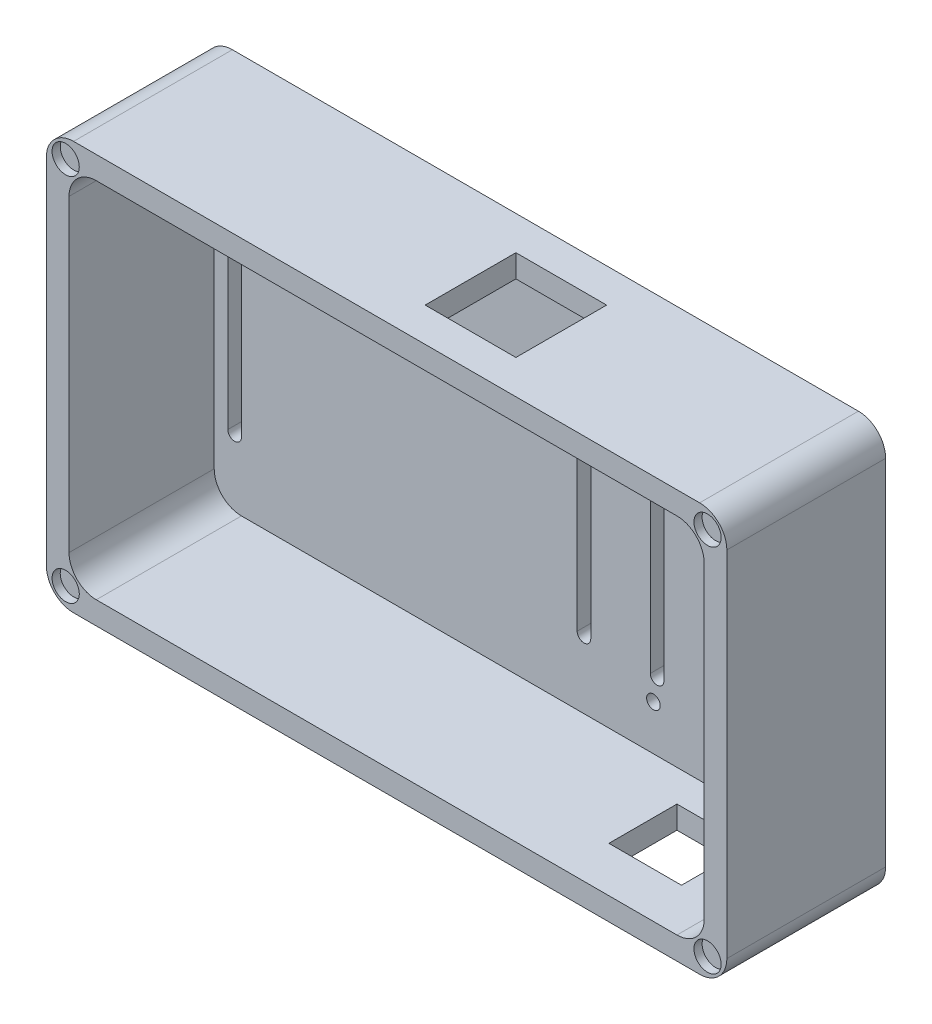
ISO-10303-21;
HEADER;
FILE_DESCRIPTION(('STEP AP214'),'2;1');
FILE_NAME('part.step','',(''),(''),'','','');
FILE_SCHEMA(('AUTOMOTIVE_DESIGN { 1 0 10303 214 1 1 1 1 }'));
ENDSEC;
DATA;
#1=APPLICATION_CONTEXT('core data for automotive mechanical design processes');
#2=APPLICATION_PROTOCOL_DEFINITION('international standard','automotive_design',2000,#1);
#3=PRODUCT_CONTEXT('',#1,'mechanical');
#4=PRODUCT('Part','Part','',(#3));
#5=PRODUCT_RELATED_PRODUCT_CATEGORY('part','',(#4));
#6=PRODUCT_DEFINITION_FORMATION('','',#4);
#7=PRODUCT_DEFINITION_CONTEXT('part definition',#1,'design');
#8=PRODUCT_DEFINITION('design','',#6,#7);
#9=PRODUCT_DEFINITION_SHAPE('','',#8);
#10=(LENGTH_UNIT() NAMED_UNIT(*) SI_UNIT(.MILLI.,.METRE.));
#11=(NAMED_UNIT(*) PLANE_ANGLE_UNIT() SI_UNIT($,.RADIAN.));
#12=(NAMED_UNIT(*) SI_UNIT($,.STERADIAN.) SOLID_ANGLE_UNIT());
#13=UNCERTAINTY_MEASURE_WITH_UNIT(LENGTH_MEASURE(1.E-05),#10,'distance_accuracy_value','');
#14=(GEOMETRIC_REPRESENTATION_CONTEXT(3) GLOBAL_UNCERTAINTY_ASSIGNED_CONTEXT((#13)) GLOBAL_UNIT_ASSIGNED_CONTEXT((#10,
#11,#12)) REPRESENTATION_CONTEXT('',''));
#15=CARTESIAN_POINT('',(0.,0.,0.));
#16=DIRECTION('',(0.,0.,1.));
#17=DIRECTION('',(1.,0.,0.));
#18=AXIS2_PLACEMENT_3D('',#15,#16,#17);
#19=CARTESIAN_POINT('',(-69.,-39.,-35.));
#20=DIRECTION('',(0.,0.,1.));
#21=DIRECTION('',(1.,0.,0.));
#22=AXIS2_PLACEMENT_3D('',#19,#20,#21);
#23=CYLINDRICAL_SURFACE('',#22,6.);
#24=CARTESIAN_POINT('',(-69.,-39.,0.));
#25=DIRECTION('',(0.,0.,1.));
#26=DIRECTION('',(1.,0.,0.));
#27=AXIS2_PLACEMENT_3D('',#24,#25,#26);
#28=CIRCLE('',#27,6.);
#29=CARTESIAN_POINT('',(-75.,-39.,0.));
#30=VERTEX_POINT('',#29);
#31=CARTESIAN_POINT('',(-69.,-45.,0.));
#32=VERTEX_POINT('',#31);
#33=EDGE_CURVE('E614',#30,#32,#28,.T.);
#34=ORIENTED_EDGE('',*,*,#33,.F.);
#35=DIRECTION('',(0.,0.,1.));
#36=VECTOR('',#35,1.);
#37=CARTESIAN_POINT('',(-75.,-39.,-35.));
#38=LINE('',#37,#36);
#39=CARTESIAN_POINT('',(-75.,-39.,-35.));
#40=VERTEX_POINT('',#39);
#41=EDGE_CURVE('E700',#40,#30,#38,.T.);
#42=ORIENTED_EDGE('',*,*,#41,.F.);
#43=CARTESIAN_POINT('',(-69.,-39.,-35.));
#44=DIRECTION('',(0.,0.,1.));
#45=DIRECTION('',(1.,0.,0.));
#46=AXIS2_PLACEMENT_3D('',#43,#44,#45);
#47=CIRCLE('',#46,6.);
#48=CARTESIAN_POINT('',(-69.,-45.,-35.));
#49=VERTEX_POINT('',#48);
#50=EDGE_CURVE('E636',#40,#49,#47,.T.);
#51=ORIENTED_EDGE('',*,*,#50,.T.);
#52=DIRECTION('',(0.,0.,1.));
#53=VECTOR('',#52,1.);
#54=CARTESIAN_POINT('',(-69.,-45.,-35.));
#55=LINE('',#54,#53);
#56=EDGE_CURVE('E669',#49,#32,#55,.T.);
#57=ORIENTED_EDGE('',*,*,#56,.T.);
#58=EDGE_LOOP('',(#34,#42,#51,#57));
#59=FACE_BOUND('',#58,.T.);
#60=ADVANCED_FACE('F45',(#59),#23,.T.);
#61=CARTESIAN_POINT('',(-75.,-39.,-35.));
#62=DIRECTION('',(-1.,0.,0.));
#63=DIRECTION('',(0.,0.,1.));
#64=AXIS2_PLACEMENT_3D('',#61,#62,#63);
#65=PLANE('',#64);
#66=DIRECTION('',(0.,-1.,0.));
#67=VECTOR('',#66,1.);
#68=CARTESIAN_POINT('',(-75.,-39.,0.));
#69=LINE('',#68,#67);
#70=CARTESIAN_POINT('',(-75.,39.,0.));
#71=VERTEX_POINT('',#70);
#72=EDGE_CURVE('E641',#71,#30,#69,.T.);
#73=ORIENTED_EDGE('',*,*,#72,.F.);
#74=DIRECTION('',(0.,0.,1.));
#75=VECTOR('',#74,1.);
#76=CARTESIAN_POINT('',(-75.,39.,-35.));
#77=LINE('',#76,#75);
#78=CARTESIAN_POINT('',(-75.,39.,-35.));
#79=VERTEX_POINT('',#78);
#80=EDGE_CURVE('E704',#79,#71,#77,.T.);
#81=ORIENTED_EDGE('',*,*,#80,.F.);
#82=DIRECTION('',(0.,-1.,0.));
#83=VECTOR('',#82,1.);
#84=CARTESIAN_POINT('',(-75.,-39.,-35.));
#85=LINE('',#84,#83);
#86=EDGE_CURVE('E665',#79,#40,#85,.T.);
#87=ORIENTED_EDGE('',*,*,#86,.T.);
#88=ORIENTED_EDGE('',*,*,#41,.T.);
#89=EDGE_LOOP('',(#73,#81,#87,#88));
#90=FACE_BOUND('',#89,.T.);
#91=ADVANCED_FACE('F821',(#90),#65,.T.);
#92=CARTESIAN_POINT('',(-69.,39.,-35.));
#93=DIRECTION('',(0.,0.,1.));
#94=DIRECTION('',(1.,0.,0.));
#95=AXIS2_PLACEMENT_3D('',#92,#93,#94);
#96=CYLINDRICAL_SURFACE('',#95,6.00000000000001);
#97=CARTESIAN_POINT('',(-69.,39.,0.));
#98=DIRECTION('',(0.,0.,1.));
#99=DIRECTION('',(1.,0.,0.));
#100=AXIS2_PLACEMENT_3D('',#97,#98,#99);
#101=CIRCLE('',#100,6.00000000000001);
#102=CARTESIAN_POINT('',(-69.,45.,0.));
#103=VERTEX_POINT('',#102);
#104=EDGE_CURVE('E693',#103,#71,#101,.T.);
#105=ORIENTED_EDGE('',*,*,#104,.F.);
#106=DIRECTION('',(0.,0.,1.));
#107=VECTOR('',#106,1.);
#108=CARTESIAN_POINT('',(-69.,45.,-35.));
#109=LINE('',#108,#107);
#110=CARTESIAN_POINT('',(-69.,45.,-35.));
#111=VERTEX_POINT('',#110);
#112=EDGE_CURVE('E707',#111,#103,#109,.T.);
#113=ORIENTED_EDGE('',*,*,#112,.F.);
#114=CARTESIAN_POINT('',(-69.,39.,-35.));
#115=DIRECTION('',(0.,0.,1.));
#116=DIRECTION('',(1.,0.,0.));
#117=AXIS2_PLACEMENT_3D('',#114,#115,#116);
#118=CIRCLE('',#117,6.00000000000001);
#119=EDGE_CURVE('E661',#111,#79,#118,.T.);
#120=ORIENTED_EDGE('',*,*,#119,.T.);
#121=ORIENTED_EDGE('',*,*,#80,.T.);
#122=EDGE_LOOP('',(#105,#113,#120,#121));
#123=FACE_BOUND('',#122,.T.);
#124=ADVANCED_FACE('F826',(#123),#96,.T.);
#125=CARTESIAN_POINT('',(-69.,45.,-35.));
#126=DIRECTION('',(0.,1.,0.));
#127=DIRECTION('',(-1.,0.,0.));
#128=AXIS2_PLACEMENT_3D('',#125,#126,#127);
#129=PLANE('',#128);
#130=DIRECTION('',(0.,0.,1.));
#131=VECTOR('',#130,1.);
#132=CARTESIAN_POINT('',(1.00000000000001,45.,-27.5));
#133=LINE('',#132,#131);
#134=CARTESIAN_POINT('',(1.00000000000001,45.,-27.5));
#135=VERTEX_POINT('',#134);
#136=CARTESIAN_POINT('',(1.00000000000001,45.,-7.5));
#137=VERTEX_POINT('',#136);
#138=EDGE_CURVE('E333',#135,#137,#133,.T.);
#139=ORIENTED_EDGE('',*,*,#138,.F.);
#140=DIRECTION('',(-1.,0.,0.));
#141=VECTOR('',#140,1.);
#142=CARTESIAN_POINT('',(1.00000000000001,45.,-27.5));
#143=LINE('',#142,#141);
#144=CARTESIAN_POINT('',(21.,45.,-27.5));
#145=VERTEX_POINT('',#144);
#146=EDGE_CURVE('E343',#145,#135,#143,.T.);
#147=ORIENTED_EDGE('',*,*,#146,.F.);
#148=DIRECTION('',(0.,0.,-1.));
#149=VECTOR('',#148,1.);
#150=CARTESIAN_POINT('',(21.,45.,-27.5));
#151=LINE('',#150,#149);
#152=CARTESIAN_POINT('',(21.,45.,-7.5));
#153=VERTEX_POINT('',#152);
#154=EDGE_CURVE('E362',#153,#145,#151,.T.);
#155=ORIENTED_EDGE('',*,*,#154,.F.);
#156=DIRECTION('',(1.,0.,0.));
#157=VECTOR('',#156,1.);
#158=CARTESIAN_POINT('',(1.00000000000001,45.,-7.5));
#159=LINE('',#158,#157);
#160=EDGE_CURVE('E358',#137,#153,#159,.T.);
#161=ORIENTED_EDGE('',*,*,#160,.F.);
#162=EDGE_LOOP('',(#139,#147,#155,#161));
#163=FACE_BOUND('',#162,.T.);
#164=DIRECTION('',(-1.,0.,0.));
#165=VECTOR('',#164,1.);
#166=CARTESIAN_POINT('',(-69.,45.,0.));
#167=LINE('',#166,#165);
#168=CARTESIAN_POINT('',(69.,45.,0.));
#169=VERTEX_POINT('',#168);
#170=EDGE_CURVE('E689',#169,#103,#167,.T.);
#171=ORIENTED_EDGE('',*,*,#170,.F.);
#172=DIRECTION('',(0.,0.,1.));
#173=VECTOR('',#172,1.);
#174=CARTESIAN_POINT('',(69.,45.,-35.));
#175=LINE('',#174,#173);
#176=CARTESIAN_POINT('',(69.,45.,-35.));
#177=VERTEX_POINT('',#176);
#178=EDGE_CURVE('E710',#177,#169,#175,.T.);
#179=ORIENTED_EDGE('',*,*,#178,.F.);
#180=DIRECTION('',(-1.,0.,0.));
#181=VECTOR('',#180,1.);
#182=CARTESIAN_POINT('',(-69.,45.,-35.));
#183=LINE('',#182,#181);
#184=EDGE_CURVE('E657',#177,#111,#183,.T.);
#185=ORIENTED_EDGE('',*,*,#184,.T.);
#186=ORIENTED_EDGE('',*,*,#112,.T.);
#187=EDGE_LOOP('',(#171,#179,#185,#186));
#188=FACE_BOUND('',#187,.T.);
#189=ADVANCED_FACE('F856',(#163,#188),#129,.T.);
#190=CARTESIAN_POINT('',(69.,39.,-35.));
#191=DIRECTION('',(0.,0.,1.));
#192=DIRECTION('',(1.,0.,0.));
#193=AXIS2_PLACEMENT_3D('',#190,#191,#192);
#194=CYLINDRICAL_SURFACE('',#193,6.);
#195=CARTESIAN_POINT('',(69.,39.,0.));
#196=DIRECTION('',(0.,0.,1.));
#197=DIRECTION('',(1.,0.,0.));
#198=AXIS2_PLACEMENT_3D('',#195,#196,#197);
#199=CIRCLE('',#198,6.);
#200=CARTESIAN_POINT('',(75.,39.,0.));
#201=VERTEX_POINT('',#200);
#202=EDGE_CURVE('E685',#201,#169,#199,.T.);
#203=ORIENTED_EDGE('',*,*,#202,.F.);
#204=DIRECTION('',(0.,0.,1.));
#205=VECTOR('',#204,1.);
#206=CARTESIAN_POINT('',(75.,39.,-35.));
#207=LINE('',#206,#205);
#208=CARTESIAN_POINT('',(75.,39.,-35.));
#209=VERTEX_POINT('',#208);
#210=EDGE_CURVE('E713',#209,#201,#207,.T.);
#211=ORIENTED_EDGE('',*,*,#210,.F.);
#212=CARTESIAN_POINT('',(69.,39.,-35.));
#213=DIRECTION('',(0.,0.,1.));
#214=DIRECTION('',(1.,0.,0.));
#215=AXIS2_PLACEMENT_3D('',#212,#213,#214);
#216=CIRCLE('',#215,6.);
#217=EDGE_CURVE('E653',#209,#177,#216,.T.);
#218=ORIENTED_EDGE('',*,*,#217,.T.);
#219=ORIENTED_EDGE('',*,*,#178,.T.);
#220=EDGE_LOOP('',(#203,#211,#218,#219));
#221=FACE_BOUND('',#220,.T.);
#222=ADVANCED_FACE('F853',(#221),#194,.T.);
#223=CARTESIAN_POINT('',(75.,-39.,-35.));
#224=DIRECTION('',(1.,0.,0.));
#225=DIRECTION('',(0.,0.,-1.));
#226=AXIS2_PLACEMENT_3D('',#223,#224,#225);
#227=PLANE('',#226);
#228=DIRECTION('',(0.,1.,0.));
#229=VECTOR('',#228,1.);
#230=CARTESIAN_POINT('',(75.,-39.,0.));
#231=LINE('',#230,#229);
#232=CARTESIAN_POINT('',(75.,-39.,0.));
#233=VERTEX_POINT('',#232);
#234=EDGE_CURVE('E681',#233,#201,#231,.T.);
#235=ORIENTED_EDGE('',*,*,#234,.F.);
#236=DIRECTION('',(0.,0.,1.));
#237=VECTOR('',#236,1.);
#238=CARTESIAN_POINT('',(75.,-39.,-35.));
#239=LINE('',#238,#237);
#240=CARTESIAN_POINT('',(75.,-39.,-35.));
#241=VERTEX_POINT('',#240);
#242=EDGE_CURVE('E716',#241,#233,#239,.T.);
#243=ORIENTED_EDGE('',*,*,#242,.F.);
#244=DIRECTION('',(0.,1.,0.));
#245=VECTOR('',#244,1.);
#246=CARTESIAN_POINT('',(75.,-39.,-35.));
#247=LINE('',#246,#245);
#248=EDGE_CURVE('E649',#241,#209,#247,.T.);
#249=ORIENTED_EDGE('',*,*,#248,.T.);
#250=ORIENTED_EDGE('',*,*,#210,.T.);
#251=EDGE_LOOP('',(#235,#243,#249,#250));
#252=FACE_BOUND('',#251,.T.);
#253=ADVANCED_FACE('F849',(#252),#227,.T.);
#254=CARTESIAN_POINT('',(69.,-39.,-35.));
#255=DIRECTION('',(0.,0.,1.));
#256=DIRECTION('',(1.,0.,0.));
#257=AXIS2_PLACEMENT_3D('',#254,#255,#256);
#258=CYLINDRICAL_SURFACE('',#257,6.);
#259=CARTESIAN_POINT('',(69.,-39.,0.));
#260=DIRECTION('',(0.,0.,1.));
#261=DIRECTION('',(1.,0.,0.));
#262=AXIS2_PLACEMENT_3D('',#259,#260,#261);
#263=CIRCLE('',#262,6.);
#264=CARTESIAN_POINT('',(69.,-45.,0.));
#265=VERTEX_POINT('',#264);
#266=EDGE_CURVE('E677',#265,#233,#263,.T.);
#267=ORIENTED_EDGE('',*,*,#266,.F.);
#268=DIRECTION('',(0.,0.,1.));
#269=VECTOR('',#268,1.);
#270=CARTESIAN_POINT('',(69.,-45.,-35.));
#271=LINE('',#270,#269);
#272=CARTESIAN_POINT('',(69.,-45.,-35.));
#273=VERTEX_POINT('',#272);
#274=EDGE_CURVE('E719',#273,#265,#271,.T.);
#275=ORIENTED_EDGE('',*,*,#274,.F.);
#276=CARTESIAN_POINT('',(69.,-39.,-35.));
#277=DIRECTION('',(0.,0.,1.));
#278=DIRECTION('',(1.,0.,0.));
#279=AXIS2_PLACEMENT_3D('',#276,#277,#278);
#280=CIRCLE('',#279,6.);
#281=EDGE_CURVE('E645',#273,#241,#280,.T.);
#282=ORIENTED_EDGE('',*,*,#281,.T.);
#283=ORIENTED_EDGE('',*,*,#242,.T.);
#284=EDGE_LOOP('',(#267,#275,#282,#283));
#285=FACE_BOUND('',#284,.T.);
#286=ADVANCED_FACE('F847',(#285),#258,.T.);
#287=CARTESIAN_POINT('',(-69.,-45.,-35.));
#288=DIRECTION('',(0.,-1.,0.));
#289=DIRECTION('',(0.,0.,-1.));
#290=AXIS2_PLACEMENT_3D('',#287,#288,#289);
#291=PLANE('',#290);
#292=DIRECTION('',(0.,0.,1.));
#293=VECTOR('',#292,1.);
#294=CARTESIAN_POINT('',(55.,-45.,-25.));
#295=LINE('',#294,#293);
#296=CARTESIAN_POINT('',(55.,-45.,-25.));
#297=VERTEX_POINT('',#296);
#298=CARTESIAN_POINT('',(55.,-45.,-10.));
#299=VERTEX_POINT('',#298);
#300=EDGE_CURVE('E60',#297,#299,#295,.T.);
#301=ORIENTED_EDGE('',*,*,#300,.F.);
#302=DIRECTION('',(1.,0.,0.));
#303=VECTOR('',#302,1.);
#304=CARTESIAN_POINT('',(55.,-45.,-25.));
#305=LINE('',#304,#303);
#306=CARTESIAN_POINT('',(39.,-45.,-25.));
#307=VERTEX_POINT('',#306);
#308=EDGE_CURVE('E323',#307,#297,#305,.T.);
#309=ORIENTED_EDGE('',*,*,#308,.F.);
#310=DIRECTION('',(0.,0.,-1.));
#311=VECTOR('',#310,1.);
#312=CARTESIAN_POINT('',(39.,-45.,-25.));
#313=LINE('',#312,#311);
#314=CARTESIAN_POINT('',(39.,-45.,-10.));
#315=VERTEX_POINT('',#314);
#316=EDGE_CURVE('E305',#315,#307,#313,.T.);
#317=ORIENTED_EDGE('',*,*,#316,.F.);
#318=DIRECTION('',(-1.,0.,0.));
#319=VECTOR('',#318,1.);
#320=CARTESIAN_POINT('',(55.,-45.,-10.));
#321=LINE('',#320,#319);
#322=EDGE_CURVE('E315',#299,#315,#321,.T.);
#323=ORIENTED_EDGE('',*,*,#322,.F.);
#324=EDGE_LOOP('',(#301,#309,#317,#323));
#325=FACE_BOUND('',#324,.T.);
#326=DIRECTION('',(1.,0.,0.));
#327=VECTOR('',#326,1.);
#328=CARTESIAN_POINT('',(-69.,-45.,0.));
#329=LINE('',#328,#327);
#330=EDGE_CURVE('E673',#32,#265,#329,.T.);
#331=ORIENTED_EDGE('',*,*,#330,.F.);
#332=ORIENTED_EDGE('',*,*,#56,.F.);
#333=DIRECTION('',(1.,0.,0.));
#334=VECTOR('',#333,1.);
#335=CARTESIAN_POINT('',(-69.,-45.,-35.));
#336=LINE('',#335,#334);
#337=EDGE_CURVE('E640',#49,#273,#336,.T.);
#338=ORIENTED_EDGE('',*,*,#337,.T.);
#339=ORIENTED_EDGE('',*,*,#274,.T.);
#340=EDGE_LOOP('',(#331,#332,#338,#339));
#341=FACE_BOUND('',#340,.T.);
#342=ADVANCED_FACE('F320',(#325,#341),#291,.T.);
#343=CARTESIAN_POINT('',(-69.,-39.,-35.));
#344=DIRECTION('',(0.,0.,1.));
#345=DIRECTION('',(1.,0.,0.));
#346=AXIS2_PLACEMENT_3D('',#343,#344,#345);
#347=PLANE('',#346);
#348=CARTESIAN_POINT('',(60.72,32.25,-35.));
#349=DIRECTION('',(0.,0.,1.));
#350=DIRECTION('',(1.,0.,0.));
#351=AXIS2_PLACEMENT_3D('',#348,#349,#350);
#352=CIRCLE('',#351,1.49999999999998);
#353=CARTESIAN_POINT('',(62.22,32.25,-35.));
#354=VERTEX_POINT('',#353);
#355=EDGE_CURVE('E382',#354,#354,#352,.T.);
#356=ORIENTED_EDGE('',*,*,#355,.T.);
#357=EDGE_LOOP('',(#356));
#358=FACE_BOUND('',#357,.T.);
#359=DIRECTION('',(0.,1.,0.));
#360=VECTOR('',#359,1.);
#361=CARTESIAN_POINT('',(29.12,25.,-35.));
#362=LINE('',#361,#360);
#363=CARTESIAN_POINT('',(29.12,-25.,-35.));
#364=VERTEX_POINT('',#363);
#365=CARTESIAN_POINT('',(29.12,25.,-35.));
#366=VERTEX_POINT('',#365);
#367=EDGE_CURVE('E391',#364,#366,#362,.T.);
#368=ORIENTED_EDGE('',*,*,#367,.T.);
#369=CARTESIAN_POINT('',(27.62,25.,-35.));
#370=DIRECTION('',(0.,0.,1.));
#371=DIRECTION('',(-1.,0.,0.));
#372=AXIS2_PLACEMENT_3D('',#369,#370,#371);
#373=CIRCLE('',#372,1.49999999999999);
#374=CARTESIAN_POINT('',(26.12,25.,-35.));
#375=VERTEX_POINT('',#374);
#376=EDGE_CURVE('E414',#366,#375,#373,.T.);
#377=ORIENTED_EDGE('',*,*,#376,.T.);
#378=DIRECTION('',(0.,-1.,0.));
#379=VECTOR('',#378,1.);
#380=CARTESIAN_POINT('',(26.12,25.,-35.));
#381=LINE('',#380,#379);
#382=CARTESIAN_POINT('',(26.12,-25.,-35.));
#383=VERTEX_POINT('',#382);
#384=EDGE_CURVE('E410',#375,#383,#381,.T.);
#385=ORIENTED_EDGE('',*,*,#384,.T.);
#386=CARTESIAN_POINT('',(27.62,-25.,-35.));
#387=DIRECTION('',(0.,0.,1.));
#388=DIRECTION('',(1.,0.,0.));
#389=AXIS2_PLACEMENT_3D('',#386,#387,#388);
#390=CIRCLE('',#389,1.50000000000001);
#391=EDGE_CURVE('E406',#383,#364,#390,.T.);
#392=ORIENTED_EDGE('',*,*,#391,.T.);
#393=EDGE_LOOP('',(#368,#377,#385,#392));
#394=FACE_BOUND('',#393,.T.);
#395=CARTESIAN_POINT('',(26.81,-30.09,-35.));
#396=DIRECTION('',(0.,0.,1.));
#397=DIRECTION('',(1.,0.,0.));
#398=AXIS2_PLACEMENT_3D('',#395,#396,#397);
#399=CIRCLE('',#398,1.5);
#400=CARTESIAN_POINT('',(28.31,-30.09,-35.));
#401=VERTEX_POINT('',#400);
#402=EDGE_CURVE('E387',#401,#401,#399,.T.);
#403=ORIENTED_EDGE('',*,*,#402,.T.);
#404=EDGE_LOOP('',(#403));
#405=FACE_BOUND('',#404,.T.);
#406=DIRECTION('',(0.,1.,0.));
#407=VECTOR('',#406,1.);
#408=CARTESIAN_POINT('',(-64.,25.,-35.));
#409=LINE('',#408,#407);
#410=CARTESIAN_POINT('',(-64.,-25.,-35.));
#411=VERTEX_POINT('',#410);
#412=CARTESIAN_POINT('',(-64.,25.,-35.));
#413=VERTEX_POINT('',#412);
#414=EDGE_CURVE('E488',#411,#413,#409,.T.);
#415=ORIENTED_EDGE('',*,*,#414,.T.);
#416=CARTESIAN_POINT('',(-65.5,25.,-35.));
#417=DIRECTION('',(0.,0.,1.));
#418=DIRECTION('',(-1.,0.,0.));
#419=AXIS2_PLACEMENT_3D('',#416,#417,#418);
#420=CIRCLE('',#419,1.49999999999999);
#421=CARTESIAN_POINT('',(-67.,25.,-35.));
#422=VERTEX_POINT('',#421);
#423=EDGE_CURVE('E484',#413,#422,#420,.T.);
#424=ORIENTED_EDGE('',*,*,#423,.T.);
#425=DIRECTION('',(0.,-1.,0.));
#426=VECTOR('',#425,1.);
#427=CARTESIAN_POINT('',(-67.,25.,-35.));
#428=LINE('',#427,#426);
#429=CARTESIAN_POINT('',(-67.,-25.,-35.));
#430=VERTEX_POINT('',#429);
#431=EDGE_CURVE('E507',#422,#430,#428,.T.);
#432=ORIENTED_EDGE('',*,*,#431,.T.);
#433=CARTESIAN_POINT('',(-65.5,-25.,-35.));
#434=DIRECTION('',(0.,0.,1.));
#435=DIRECTION('',(1.,0.,0.));
#436=AXIS2_PLACEMENT_3D('',#433,#434,#435);
#437=CIRCLE('',#436,1.49999999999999);
#438=EDGE_CURVE('E503',#430,#411,#437,.T.);
#439=ORIENTED_EDGE('',*,*,#438,.T.);
#440=EDGE_LOOP('',(#415,#424,#432,#439));
#441=FACE_BOUND('',#440,.T.);
#442=DIRECTION('',(0.,1.,0.));
#443=VECTOR('',#442,1.);
#444=CARTESIAN_POINT('',(67.,25.,-35.));
#445=LINE('',#444,#443);
#446=CARTESIAN_POINT('',(67.,-25.,-35.));
#447=VERTEX_POINT('',#446);
#448=CARTESIAN_POINT('',(67.,25.,-35.));
#449=VERTEX_POINT('',#448);
#450=EDGE_CURVE('E422',#447,#449,#445,.T.);
#451=ORIENTED_EDGE('',*,*,#450,.T.);
#452=CARTESIAN_POINT('',(65.5,25.,-35.));
#453=DIRECTION('',(0.,0.,1.));
#454=DIRECTION('',(1.,0.,0.));
#455=AXIS2_PLACEMENT_3D('',#452,#453,#454);
#456=CIRCLE('',#455,1.49999999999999);
#457=CARTESIAN_POINT('',(64.,25.,-35.));
#458=VERTEX_POINT('',#457);
#459=EDGE_CURVE('E447',#449,#458,#456,.T.);
#460=ORIENTED_EDGE('',*,*,#459,.T.);
#461=DIRECTION('',(0.,-1.,0.));
#462=VECTOR('',#461,1.);
#463=CARTESIAN_POINT('',(64.,25.,-35.));
#464=LINE('',#463,#462);
#465=CARTESIAN_POINT('',(64.,-25.,-35.));
#466=VERTEX_POINT('',#465);
#467=EDGE_CURVE('E443',#458,#466,#464,.T.);
#468=ORIENTED_EDGE('',*,*,#467,.T.);
#469=CARTESIAN_POINT('',(65.5,-25.,-35.));
#470=DIRECTION('',(0.,0.,1.));
#471=DIRECTION('',(-1.,0.,0.));
#472=AXIS2_PLACEMENT_3D('',#469,#470,#471);
#473=CIRCLE('',#472,1.49999999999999);
#474=EDGE_CURVE('E439',#466,#447,#473,.T.);
#475=ORIENTED_EDGE('',*,*,#474,.T.);
#476=EDGE_LOOP('',(#451,#460,#468,#475));
#477=FACE_BOUND('',#476,.T.);
#478=DIRECTION('',(0.,1.,0.));
#479=VECTOR('',#478,1.);
#480=CARTESIAN_POINT('',(13.,25.,-35.));
#481=LINE('',#480,#479);
#482=CARTESIAN_POINT('',(13.,-25.,-35.));
#483=VERTEX_POINT('',#482);
#484=CARTESIAN_POINT('',(13.,25.,-35.));
#485=VERTEX_POINT('',#484);
#486=EDGE_CURVE('E455',#483,#485,#481,.T.);
#487=ORIENTED_EDGE('',*,*,#486,.T.);
#488=CARTESIAN_POINT('',(11.5,25.,-35.));
#489=DIRECTION('',(0.,0.,1.));
#490=DIRECTION('',(1.,0.,0.));
#491=AXIS2_PLACEMENT_3D('',#488,#489,#490);
#492=CIRCLE('',#491,1.49999999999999);
#493=CARTESIAN_POINT('',(10.,25.,-35.));
#494=VERTEX_POINT('',#493);
#495=EDGE_CURVE('E435',#485,#494,#492,.T.);
#496=ORIENTED_EDGE('',*,*,#495,.T.);
#497=DIRECTION('',(0.,-1.,0.));
#498=VECTOR('',#497,1.);
#499=CARTESIAN_POINT('',(10.,25.,-35.));
#500=LINE('',#499,#498);
#501=CARTESIAN_POINT('',(10.,-25.,-35.));
#502=VERTEX_POINT('',#501);
#503=EDGE_CURVE('E474',#494,#502,#500,.T.);
#504=ORIENTED_EDGE('',*,*,#503,.T.);
#505=CARTESIAN_POINT('',(11.5,-25.,-35.));
#506=DIRECTION('',(0.,0.,1.));
#507=DIRECTION('',(-1.,0.,0.));
#508=AXIS2_PLACEMENT_3D('',#505,#506,#507);
#509=CIRCLE('',#508,1.50000000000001);
#510=EDGE_CURVE('E470',#502,#483,#509,.T.);
#511=ORIENTED_EDGE('',*,*,#510,.T.);
#512=EDGE_LOOP('',(#487,#496,#504,#511));
#513=FACE_BOUND('',#512,.T.);
#514=ORIENTED_EDGE('',*,*,#50,.F.);
#515=ORIENTED_EDGE('',*,*,#86,.F.);
#516=ORIENTED_EDGE('',*,*,#119,.F.);
#517=ORIENTED_EDGE('',*,*,#184,.F.);
#518=ORIENTED_EDGE('',*,*,#217,.F.);
#519=ORIENTED_EDGE('',*,*,#248,.F.);
#520=ORIENTED_EDGE('',*,*,#281,.F.);
#521=ORIENTED_EDGE('',*,*,#337,.F.);
#522=EDGE_LOOP('',(#514,#515,#516,#517,#518,#519,#520,#521));
#523=FACE_BOUND('',#522,.T.);
#524=ADVANCED_FACE('F839',(#358,#394,#405,#441,#477,#513,#523),#347,.F.);
#525=CARTESIAN_POINT('',(-69.,-39.,0.));
#526=DIRECTION('',(0.,0.,1.));
#527=DIRECTION('',(1.,0.,0.));
#528=AXIS2_PLACEMENT_3D('',#525,#526,#527);
#529=PLANE('',#528);
#530=CARTESIAN_POINT('',(-70.7426406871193,-40.7426406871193,0.));
#531=DIRECTION('',(0.,0.,1.));
#532=DIRECTION('',(-1.,0.,0.));
#533=AXIS2_PLACEMENT_3D('',#530,#531,#532);
#534=CIRCLE('',#533,3.00000000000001);
#535=CARTESIAN_POINT('',(-73.7426406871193,-40.7426406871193,0.));
#536=VERTEX_POINT('',#535);
#537=EDGE_CURVE('E531',#536,#536,#534,.T.);
#538=ORIENTED_EDGE('',*,*,#537,.F.);
#539=EDGE_LOOP('',(#538));
#540=FACE_BOUND('',#539,.T.);
#541=CARTESIAN_POINT('',(70.7426406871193,-40.7426406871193,0.));
#542=DIRECTION('',(0.,0.,1.));
#543=DIRECTION('',(1.,0.,0.));
#544=AXIS2_PLACEMENT_3D('',#541,#542,#543);
#545=CIRCLE('',#544,3.00000000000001);
#546=CARTESIAN_POINT('',(73.7426406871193,-40.7426406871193,0.));
#547=VERTEX_POINT('',#546);
#548=EDGE_CURVE('E523',#547,#547,#545,.T.);
#549=ORIENTED_EDGE('',*,*,#548,.F.);
#550=EDGE_LOOP('',(#549));
#551=FACE_BOUND('',#550,.T.);
#552=CARTESIAN_POINT('',(70.7426406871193,40.7426406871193,0.));
#553=DIRECTION('',(0.,0.,1.));
#554=DIRECTION('',(-1.,0.,0.));
#555=AXIS2_PLACEMENT_3D('',#552,#553,#554);
#556=CIRCLE('',#555,3.00000000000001);
#557=CARTESIAN_POINT('',(67.7426406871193,40.7426406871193,0.));
#558=VERTEX_POINT('',#557);
#559=EDGE_CURVE('E514',#558,#558,#556,.T.);
#560=ORIENTED_EDGE('',*,*,#559,.F.);
#561=EDGE_LOOP('',(#560));
#562=FACE_BOUND('',#561,.T.);
#563=CARTESIAN_POINT('',(-70.7426406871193,40.7426406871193,0.));
#564=DIRECTION('',(0.,0.,1.));
#565=DIRECTION('',(1.,0.,0.));
#566=AXIS2_PLACEMENT_3D('',#563,#564,#565);
#567=CIRCLE('',#566,3.00000000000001);
#568=CARTESIAN_POINT('',(-67.7426406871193,40.7426406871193,0.));
#569=VERTEX_POINT('',#568);
#570=EDGE_CURVE('E518',#569,#569,#567,.T.);
#571=ORIENTED_EDGE('',*,*,#570,.F.);
#572=EDGE_LOOP('',(#571));
#573=FACE_BOUND('',#572,.T.);
#574=CARTESIAN_POINT('',(64.,34.,0.));
#575=DIRECTION('',(0.,0.,1.));
#576=DIRECTION('',(-1.,0.,0.));
#577=AXIS2_PLACEMENT_3D('',#574,#575,#576);
#578=CIRCLE('',#577,6.);
#579=CARTESIAN_POINT('',(70.,34.,0.));
#580=VERTEX_POINT('',#579);
#581=CARTESIAN_POINT('',(64.,40.,0.));
#582=VERTEX_POINT('',#581);
#583=EDGE_CURVE('E544',#580,#582,#578,.T.);
#584=ORIENTED_EDGE('',*,*,#583,.F.);
#585=DIRECTION('',(0.,1.,0.));
#586=VECTOR('',#585,1.);
#587=CARTESIAN_POINT('',(70.,-34.,0.));
#588=LINE('',#587,#586);
#589=CARTESIAN_POINT('',(70.,-34.,0.));
#590=VERTEX_POINT('',#589);
#591=EDGE_CURVE('E553',#590,#580,#588,.T.);
#592=ORIENTED_EDGE('',*,*,#591,.F.);
#593=CARTESIAN_POINT('',(64.,-34.,0.));
#594=DIRECTION('',(0.,0.,1.));
#595=DIRECTION('',(-1.,0.,0.));
#596=AXIS2_PLACEMENT_3D('',#593,#594,#595);
#597=CIRCLE('',#596,6.);
#598=CARTESIAN_POINT('',(64.,-40.,0.));
#599=VERTEX_POINT('',#598);
#600=EDGE_CURVE('E604',#599,#590,#597,.T.);
#601=ORIENTED_EDGE('',*,*,#600,.F.);
#602=DIRECTION('',(1.,0.,0.));
#603=VECTOR('',#602,1.);
#604=CARTESIAN_POINT('',(64.,-40.,0.));
#605=LINE('',#604,#603);
#606=CARTESIAN_POINT('',(-64.,-40.,0.));
#607=VERTEX_POINT('',#606);
#608=EDGE_CURVE('E600',#607,#599,#605,.T.);
#609=ORIENTED_EDGE('',*,*,#608,.F.);
#610=CARTESIAN_POINT('',(-64.,-34.,0.));
#611=DIRECTION('',(0.,0.,1.));
#612=DIRECTION('',(-1.,0.,0.));
#613=AXIS2_PLACEMENT_3D('',#610,#611,#612);
#614=CIRCLE('',#613,6.);
#615=CARTESIAN_POINT('',(-70.,-34.,0.));
#616=VERTEX_POINT('',#615);
#617=EDGE_CURVE('E596',#616,#607,#614,.T.);
#618=ORIENTED_EDGE('',*,*,#617,.F.);
#619=DIRECTION('',(0.,-1.,0.));
#620=VECTOR('',#619,1.);
#621=CARTESIAN_POINT('',(-70.,-34.,0.));
#622=LINE('',#621,#620);
#623=CARTESIAN_POINT('',(-70.,34.,0.));
#624=VERTEX_POINT('',#623);
#625=EDGE_CURVE('E592',#624,#616,#622,.T.);
#626=ORIENTED_EDGE('',*,*,#625,.F.);
#627=CARTESIAN_POINT('',(-64.,34.,0.));
#628=DIRECTION('',(0.,0.,1.));
#629=DIRECTION('',(-1.,0.,0.));
#630=AXIS2_PLACEMENT_3D('',#627,#628,#629);
#631=CIRCLE('',#630,6.);
#632=CARTESIAN_POINT('',(-64.,40.,0.));
#633=VERTEX_POINT('',#632);
#634=EDGE_CURVE('E588',#633,#624,#631,.T.);
#635=ORIENTED_EDGE('',*,*,#634,.F.);
#636=DIRECTION('',(-1.,0.,0.));
#637=VECTOR('',#636,1.);
#638=CARTESIAN_POINT('',(64.,40.,0.));
#639=LINE('',#638,#637);
#640=EDGE_CURVE('E584',#582,#633,#639,.T.);
#641=ORIENTED_EDGE('',*,*,#640,.F.);
#642=EDGE_LOOP('',(#584,#592,#601,#609,#618,#626,#635,#641));
#643=FACE_BOUND('',#642,.T.);
#644=ORIENTED_EDGE('',*,*,#33,.T.);
#645=ORIENTED_EDGE('',*,*,#330,.T.);
#646=ORIENTED_EDGE('',*,*,#266,.T.);
#647=ORIENTED_EDGE('',*,*,#234,.T.);
#648=ORIENTED_EDGE('',*,*,#202,.T.);
#649=ORIENTED_EDGE('',*,*,#170,.T.);
#650=ORIENTED_EDGE('',*,*,#104,.T.);
#651=ORIENTED_EDGE('',*,*,#72,.T.);
#652=EDGE_LOOP('',(#644,#645,#646,#647,#648,#649,#650,#651));
#653=FACE_BOUND('',#652,.T.);
#654=ADVANCED_FACE('F834',(#540,#551,#562,#573,#643,#653),#529,.T.);
#655=CARTESIAN_POINT('',(64.,34.,-32.));
#656=DIRECTION('',(0.,0.,1.));
#657=DIRECTION('',(1.,0.,0.));
#658=AXIS2_PLACEMENT_3D('',#655,#656,#657);
#659=CYLINDRICAL_SURFACE('',#658,6.);
#660=ORIENTED_EDGE('',*,*,#583,.T.);
#661=DIRECTION('',(0.,0.,1.));
#662=VECTOR('',#661,1.);
#663=CARTESIAN_POINT('',(64.,40.,-32.));
#664=LINE('',#663,#662);
#665=CARTESIAN_POINT('',(64.,40.,-32.));
#666=VERTEX_POINT('',#665);
#667=EDGE_CURVE('E581',#666,#582,#664,.T.);
#668=ORIENTED_EDGE('',*,*,#667,.F.);
#669=CARTESIAN_POINT('',(64.,34.,-32.));
#670=DIRECTION('',(0.,0.,1.));
#671=DIRECTION('',(-1.,0.,0.));
#672=AXIS2_PLACEMENT_3D('',#669,#670,#671);
#673=CIRCLE('',#672,6.);
#674=CARTESIAN_POINT('',(70.,34.,-32.));
#675=VERTEX_POINT('',#674);
#676=EDGE_CURVE('E548',#675,#666,#673,.T.);
#677=ORIENTED_EDGE('',*,*,#676,.F.);
#678=DIRECTION('',(0.,0.,1.));
#679=VECTOR('',#678,1.);
#680=CARTESIAN_POINT('',(70.,34.,-32.));
#681=LINE('',#680,#679);
#682=EDGE_CURVE('E611',#675,#580,#681,.T.);
#683=ORIENTED_EDGE('',*,*,#682,.T.);
#684=EDGE_LOOP('',(#660,#668,#677,#683));
#685=FACE_BOUND('',#684,.T.);
#686=ADVANCED_FACE('F883',(#685),#659,.F.);
#687=CARTESIAN_POINT('',(70.,-34.,-32.));
#688=DIRECTION('',(1.,0.,0.));
#689=DIRECTION('',(0.,0.,-1.));
#690=AXIS2_PLACEMENT_3D('',#687,#688,#689);
#691=PLANE('',#690);
#692=ORIENTED_EDGE('',*,*,#591,.T.);
#693=ORIENTED_EDGE('',*,*,#682,.F.);
#694=DIRECTION('',(0.,1.,0.));
#695=VECTOR('',#694,1.);
#696=CARTESIAN_POINT('',(70.,-34.,-32.));
#697=LINE('',#696,#695);
#698=CARTESIAN_POINT('',(70.,-34.,-32.));
#699=VERTEX_POINT('',#698);
#700=EDGE_CURVE('E577',#699,#675,#697,.T.);
#701=ORIENTED_EDGE('',*,*,#700,.F.);
#702=DIRECTION('',(0.,0.,1.));
#703=VECTOR('',#702,1.);
#704=CARTESIAN_POINT('',(70.,-34.,-32.));
#705=LINE('',#704,#703);
#706=EDGE_CURVE('E615',#699,#590,#705,.T.);
#707=ORIENTED_EDGE('',*,*,#706,.T.);
#708=EDGE_LOOP('',(#692,#693,#701,#707));
#709=FACE_BOUND('',#708,.T.);
#710=ADVANCED_FACE('F889',(#709),#691,.F.);
#711=CARTESIAN_POINT('',(64.,-34.,-32.));
#712=DIRECTION('',(0.,0.,1.));
#713=DIRECTION('',(1.,0.,0.));
#714=AXIS2_PLACEMENT_3D('',#711,#712,#713);
#715=CYLINDRICAL_SURFACE('',#714,6.);
#716=ORIENTED_EDGE('',*,*,#600,.T.);
#717=ORIENTED_EDGE('',*,*,#706,.F.);
#718=CARTESIAN_POINT('',(64.,-34.,-32.));
#719=DIRECTION('',(0.,0.,1.));
#720=DIRECTION('',(-1.,0.,0.));
#721=AXIS2_PLACEMENT_3D('',#718,#719,#720);
#722=CIRCLE('',#721,6.);
#723=CARTESIAN_POINT('',(64.,-40.,-32.));
#724=VERTEX_POINT('',#723);
#725=EDGE_CURVE('E573',#724,#699,#722,.T.);
#726=ORIENTED_EDGE('',*,*,#725,.F.);
#727=DIRECTION('',(0.,0.,1.));
#728=VECTOR('',#727,1.);
#729=CARTESIAN_POINT('',(64.,-40.,-32.));
#730=LINE('',#729,#728);
#731=EDGE_CURVE('E618',#724,#599,#730,.T.);
#732=ORIENTED_EDGE('',*,*,#731,.T.);
#733=EDGE_LOOP('',(#716,#717,#726,#732));
#734=FACE_BOUND('',#733,.T.);
#735=ADVANCED_FACE('F909',(#734),#715,.F.);
#736=CARTESIAN_POINT('',(64.,-40.,-32.));
#737=DIRECTION('',(0.,-1.,0.));
#738=DIRECTION('',(1.,0.,0.));
#739=AXIS2_PLACEMENT_3D('',#736,#737,#738);
#740=PLANE('',#739);
#741=DIRECTION('',(1.,0.,0.));
#742=VECTOR('',#741,1.);
#743=CARTESIAN_POINT('',(64.,-40.,-25.));
#744=LINE('',#743,#742);
#745=CARTESIAN_POINT('',(39.,-40.,-25.));
#746=VERTEX_POINT('',#745);
#747=CARTESIAN_POINT('',(55.,-40.,-25.));
#748=VERTEX_POINT('',#747);
#749=EDGE_CURVE('E53',#746,#748,#744,.T.);
#750=ORIENTED_EDGE('',*,*,#749,.T.);
#751=DIRECTION('',(0.,0.,1.));
#752=VECTOR('',#751,1.);
#753=CARTESIAN_POINT('',(55.,-40.,-32.));
#754=LINE('',#753,#752);
#755=CARTESIAN_POINT('',(55.,-40.,-10.));
#756=VERTEX_POINT('',#755);
#757=EDGE_CURVE('E11',#748,#756,#754,.T.);
#758=ORIENTED_EDGE('',*,*,#757,.T.);
#759=DIRECTION('',(-1.,0.,0.));
#760=VECTOR('',#759,1.);
#761=CARTESIAN_POINT('',(64.,-40.,-10.));
#762=LINE('',#761,#760);
#763=CARTESIAN_POINT('',(39.,-40.,-10.));
#764=VERTEX_POINT('',#763);
#765=EDGE_CURVE('E790',#756,#764,#762,.T.);
#766=ORIENTED_EDGE('',*,*,#765,.T.);
#767=DIRECTION('',(0.,0.,-1.));
#768=VECTOR('',#767,1.);
#769=CARTESIAN_POINT('',(39.,-40.,-32.));
#770=LINE('',#769,#768);
#771=EDGE_CURVE('E308',#764,#746,#770,.T.);
#772=ORIENTED_EDGE('',*,*,#771,.T.);
#773=EDGE_LOOP('',(#750,#758,#766,#772));
#774=FACE_BOUND('',#773,.T.);
#775=ORIENTED_EDGE('',*,*,#608,.T.);
#776=ORIENTED_EDGE('',*,*,#731,.F.);
#777=DIRECTION('',(1.,0.,0.));
#778=VECTOR('',#777,1.);
#779=CARTESIAN_POINT('',(64.,-40.,-32.));
#780=LINE('',#779,#778);
#781=CARTESIAN_POINT('',(-64.,-40.,-32.));
#782=VERTEX_POINT('',#781);
#783=EDGE_CURVE('E569',#782,#724,#780,.T.);
#784=ORIENTED_EDGE('',*,*,#783,.F.);
#785=DIRECTION('',(0.,0.,1.));
#786=VECTOR('',#785,1.);
#787=CARTESIAN_POINT('',(-64.,-40.,-32.));
#788=LINE('',#787,#786);
#789=EDGE_CURVE('E621',#782,#607,#788,.T.);
#790=ORIENTED_EDGE('',*,*,#789,.T.);
#791=EDGE_LOOP('',(#775,#776,#784,#790));
#792=FACE_BOUND('',#791,.T.);
#793=ADVANCED_FACE('F800',(#774,#792),#740,.F.);
#794=CARTESIAN_POINT('',(-64.,-34.,-32.));
#795=DIRECTION('',(0.,0.,1.));
#796=DIRECTION('',(1.,0.,0.));
#797=AXIS2_PLACEMENT_3D('',#794,#795,#796);
#798=CYLINDRICAL_SURFACE('',#797,6.);
#799=ORIENTED_EDGE('',*,*,#617,.T.);
#800=ORIENTED_EDGE('',*,*,#789,.F.);
#801=CARTESIAN_POINT('',(-64.,-34.,-32.));
#802=DIRECTION('',(0.,0.,1.));
#803=DIRECTION('',(-1.,0.,0.));
#804=AXIS2_PLACEMENT_3D('',#801,#802,#803);
#805=CIRCLE('',#804,6.);
#806=CARTESIAN_POINT('',(-70.,-34.,-32.));
#807=VERTEX_POINT('',#806);
#808=EDGE_CURVE('E565',#807,#782,#805,.T.);
#809=ORIENTED_EDGE('',*,*,#808,.F.);
#810=DIRECTION('',(0.,0.,1.));
#811=VECTOR('',#810,1.);
#812=CARTESIAN_POINT('',(-70.,-34.,-32.));
#813=LINE('',#812,#811);
#814=EDGE_CURVE('E624',#807,#616,#813,.T.);
#815=ORIENTED_EDGE('',*,*,#814,.T.);
#816=EDGE_LOOP('',(#799,#800,#809,#815));
#817=FACE_BOUND('',#816,.T.);
#818=ADVANCED_FACE('F903',(#817),#798,.F.);
#819=CARTESIAN_POINT('',(-70.,-34.,-32.));
#820=DIRECTION('',(-1.,0.,0.));
#821=DIRECTION('',(0.,-1.,0.));
#822=AXIS2_PLACEMENT_3D('',#819,#820,#821);
#823=PLANE('',#822);
#824=ORIENTED_EDGE('',*,*,#625,.T.);
#825=ORIENTED_EDGE('',*,*,#814,.F.);
#826=DIRECTION('',(0.,-1.,0.));
#827=VECTOR('',#826,1.);
#828=CARTESIAN_POINT('',(-70.,-34.,-32.));
#829=LINE('',#828,#827);
#830=CARTESIAN_POINT('',(-70.,34.,-32.));
#831=VERTEX_POINT('',#830);
#832=EDGE_CURVE('E561',#831,#807,#829,.T.);
#833=ORIENTED_EDGE('',*,*,#832,.F.);
#834=DIRECTION('',(0.,0.,1.));
#835=VECTOR('',#834,1.);
#836=CARTESIAN_POINT('',(-70.,34.,-32.));
#837=LINE('',#836,#835);
#838=EDGE_CURVE('E627',#831,#624,#837,.T.);
#839=ORIENTED_EDGE('',*,*,#838,.T.);
#840=EDGE_LOOP('',(#824,#825,#833,#839));
#841=FACE_BOUND('',#840,.T.);
#842=ADVANCED_FACE('F899',(#841),#823,.F.);
#843=CARTESIAN_POINT('',(-64.,34.,-32.));
#844=DIRECTION('',(0.,0.,1.));
#845=DIRECTION('',(1.,0.,0.));
#846=AXIS2_PLACEMENT_3D('',#843,#844,#845);
#847=CYLINDRICAL_SURFACE('',#846,6.);
#848=ORIENTED_EDGE('',*,*,#634,.T.);
#849=ORIENTED_EDGE('',*,*,#838,.F.);
#850=CARTESIAN_POINT('',(-64.,34.,-32.));
#851=DIRECTION('',(0.,0.,1.));
#852=DIRECTION('',(-1.,0.,0.));
#853=AXIS2_PLACEMENT_3D('',#850,#851,#852);
#854=CIRCLE('',#853,6.);
#855=CARTESIAN_POINT('',(-64.,40.,-32.));
#856=VERTEX_POINT('',#855);
#857=EDGE_CURVE('E557',#856,#831,#854,.T.);
#858=ORIENTED_EDGE('',*,*,#857,.F.);
#859=DIRECTION('',(0.,0.,1.));
#860=VECTOR('',#859,1.);
#861=CARTESIAN_POINT('',(-64.,40.,-32.));
#862=LINE('',#861,#860);
#863=EDGE_CURVE('E630',#856,#633,#862,.T.);
#864=ORIENTED_EDGE('',*,*,#863,.T.);
#865=EDGE_LOOP('',(#848,#849,#858,#864));
#866=FACE_BOUND('',#865,.T.);
#867=ADVANCED_FACE('F895',(#866),#847,.F.);
#868=CARTESIAN_POINT('',(64.,40.,-32.));
#869=DIRECTION('',(0.,1.,0.));
#870=DIRECTION('',(-1.,0.,0.));
#871=AXIS2_PLACEMENT_3D('',#868,#869,#870);
#872=PLANE('',#871);
#873=DIRECTION('',(-1.,0.,0.));
#874=VECTOR('',#873,1.);
#875=CARTESIAN_POINT('',(1.00000000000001,40.,-27.5));
#876=LINE('',#875,#874);
#877=CARTESIAN_POINT('',(21.,40.,-27.5));
#878=VERTEX_POINT('',#877);
#879=CARTESIAN_POINT('',(1.00000000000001,40.,-27.5));
#880=VERTEX_POINT('',#879);
#881=EDGE_CURVE('E351',#878,#880,#876,.T.);
#882=ORIENTED_EDGE('',*,*,#881,.T.);
#883=DIRECTION('',(0.,0.,1.));
#884=VECTOR('',#883,1.);
#885=CARTESIAN_POINT('',(1.00000000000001,40.,-27.5));
#886=LINE('',#885,#884);
#887=CARTESIAN_POINT('',(1.00000000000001,40.,-7.5));
#888=VERTEX_POINT('',#887);
#889=EDGE_CURVE('E338',#880,#888,#886,.T.);
#890=ORIENTED_EDGE('',*,*,#889,.T.);
#891=DIRECTION('',(1.,0.,0.));
#892=VECTOR('',#891,1.);
#893=CARTESIAN_POINT('',(1.00000000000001,40.,-7.5));
#894=LINE('',#893,#892);
#895=CARTESIAN_POINT('',(21.,40.,-7.5));
#896=VERTEX_POINT('',#895);
#897=EDGE_CURVE('E342',#888,#896,#894,.T.);
#898=ORIENTED_EDGE('',*,*,#897,.T.);
#899=DIRECTION('',(0.,0.,-1.));
#900=VECTOR('',#899,1.);
#901=CARTESIAN_POINT('',(21.,40.,-27.5));
#902=LINE('',#901,#900);
#903=EDGE_CURVE('E347',#896,#878,#902,.T.);
#904=ORIENTED_EDGE('',*,*,#903,.T.);
#905=EDGE_LOOP('',(#882,#890,#898,#904));
#906=FACE_BOUND('',#905,.T.);
#907=ORIENTED_EDGE('',*,*,#640,.T.);
#908=ORIENTED_EDGE('',*,*,#863,.F.);
#909=DIRECTION('',(-1.,0.,0.));
#910=VECTOR('',#909,1.);
#911=CARTESIAN_POINT('',(64.,40.,-32.));
#912=LINE('',#911,#910);
#913=EDGE_CURVE('E552',#666,#856,#912,.T.);
#914=ORIENTED_EDGE('',*,*,#913,.F.);
#915=ORIENTED_EDGE('',*,*,#667,.T.);
#916=EDGE_LOOP('',(#907,#908,#914,#915));
#917=FACE_BOUND('',#916,.T.);
#918=ADVANCED_FACE('F891',(#906,#917),#872,.F.);
#919=CARTESIAN_POINT('',(64.,34.,-32.));
#920=DIRECTION('',(0.,0.,-1.));
#921=DIRECTION('',(-1.,0.,0.));
#922=AXIS2_PLACEMENT_3D('',#919,#920,#921);
#923=PLANE('',#922);
#924=CARTESIAN_POINT('',(60.72,32.25,-32.));
#925=DIRECTION('',(0.,0.,-1.));
#926=DIRECTION('',(-1.,0.,0.));
#927=AXIS2_PLACEMENT_3D('',#924,#925,#926);
#928=CIRCLE('',#927,1.49999999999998);
#929=CARTESIAN_POINT('',(59.22,32.25,-32.));
#930=VERTEX_POINT('',#929);
#931=EDGE_CURVE('E539',#930,#930,#928,.T.);
#932=ORIENTED_EDGE('',*,*,#931,.T.);
#933=EDGE_LOOP('',(#932));
#934=FACE_BOUND('',#933,.T.);
#935=DIRECTION('',(0.,1.,0.));
#936=VECTOR('',#935,1.);
#937=CARTESIAN_POINT('',(26.12,34.,-32.));
#938=LINE('',#937,#936);
#939=CARTESIAN_POINT('',(26.12,-25.,-32.));
#940=VERTEX_POINT('',#939);
#941=CARTESIAN_POINT('',(26.12,25.,-32.));
#942=VERTEX_POINT('',#941);
#943=EDGE_CURVE('E771',#940,#942,#938,.T.);
#944=ORIENTED_EDGE('',*,*,#943,.T.);
#945=CARTESIAN_POINT('',(27.62,25.,-32.));
#946=DIRECTION('',(0.,0.,-1.));
#947=DIRECTION('',(-1.,0.,0.));
#948=AXIS2_PLACEMENT_3D('',#945,#946,#947);
#949=CIRCLE('',#948,1.49999999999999);
#950=CARTESIAN_POINT('',(29.12,25.,-32.));
#951=VERTEX_POINT('',#950);
#952=EDGE_CURVE('E786',#942,#951,#949,.T.);
#953=ORIENTED_EDGE('',*,*,#952,.T.);
#954=DIRECTION('',(0.,-1.,0.));
#955=VECTOR('',#954,1.);
#956=CARTESIAN_POINT('',(29.12,34.,-32.));
#957=LINE('',#956,#955);
#958=CARTESIAN_POINT('',(29.12,-25.,-32.));
#959=VERTEX_POINT('',#958);
#960=EDGE_CURVE('E782',#951,#959,#957,.T.);
#961=ORIENTED_EDGE('',*,*,#960,.T.);
#962=CARTESIAN_POINT('',(27.62,-25.,-32.));
#963=DIRECTION('',(0.,0.,-1.));
#964=DIRECTION('',(-1.,0.,0.));
#965=AXIS2_PLACEMENT_3D('',#962,#963,#964);
#966=CIRCLE('',#965,1.50000000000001);
#967=EDGE_CURVE('E778',#959,#940,#966,.T.);
#968=ORIENTED_EDGE('',*,*,#967,.T.);
#969=EDGE_LOOP('',(#944,#953,#961,#968));
#970=FACE_BOUND('',#969,.T.);
#971=CARTESIAN_POINT('',(26.81,-30.09,-32.));
#972=DIRECTION('',(0.,0.,-1.));
#973=DIRECTION('',(-1.,0.,0.));
#974=AXIS2_PLACEMENT_3D('',#971,#972,#973);
#975=CIRCLE('',#974,1.5);
#976=CARTESIAN_POINT('',(25.31,-30.09,-32.));
#977=VERTEX_POINT('',#976);
#978=EDGE_CURVE('E386',#977,#977,#975,.T.);
#979=ORIENTED_EDGE('',*,*,#978,.T.);
#980=EDGE_LOOP('',(#979));
#981=FACE_BOUND('',#980,.T.);
#982=DIRECTION('',(0.,1.,0.));
#983=VECTOR('',#982,1.);
#984=CARTESIAN_POINT('',(-67.,34.,-32.));
#985=LINE('',#984,#983);
#986=CARTESIAN_POINT('',(-67.,-25.,-32.));
#987=VERTEX_POINT('',#986);
#988=CARTESIAN_POINT('',(-67.,25.,-32.));
#989=VERTEX_POINT('',#988);
#990=EDGE_CURVE('E755',#987,#989,#985,.T.);
#991=ORIENTED_EDGE('',*,*,#990,.T.);
#992=CARTESIAN_POINT('',(-65.5,25.,-32.));
#993=DIRECTION('',(0.,0.,-1.));
#994=DIRECTION('',(-1.,0.,0.));
#995=AXIS2_PLACEMENT_3D('',#992,#993,#994);
#996=CIRCLE('',#995,1.49999999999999);
#997=CARTESIAN_POINT('',(-64.,25.,-32.));
#998=VERTEX_POINT('',#997);
#999=EDGE_CURVE('E767',#989,#998,#996,.T.);
#1000=ORIENTED_EDGE('',*,*,#999,.T.);
#1001=DIRECTION('',(0.,-1.,0.));
#1002=VECTOR('',#1001,1.);
#1003=CARTESIAN_POINT('',(-64.,34.,-32.));
#1004=LINE('',#1003,#1002);
#1005=CARTESIAN_POINT('',(-64.,-25.,-32.));
#1006=VERTEX_POINT('',#1005);
#1007=EDGE_CURVE('E763',#998,#1006,#1004,.T.);
#1008=ORIENTED_EDGE('',*,*,#1007,.T.);
#1009=CARTESIAN_POINT('',(-65.5,-25.,-32.));
#1010=DIRECTION('',(0.,0.,-1.));
#1011=DIRECTION('',(-1.,0.,0.));
#1012=AXIS2_PLACEMENT_3D('',#1009,#1010,#1011);
#1013=CIRCLE('',#1012,1.49999999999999);
#1014=EDGE_CURVE('E759',#1006,#987,#1013,.T.);
#1015=ORIENTED_EDGE('',*,*,#1014,.T.);
#1016=EDGE_LOOP('',(#991,#1000,#1008,#1015));
#1017=FACE_BOUND('',#1016,.T.);
#1018=DIRECTION('',(0.,1.,0.));
#1019=VECTOR('',#1018,1.);
#1020=CARTESIAN_POINT('',(64.,34.,-32.));
#1021=LINE('',#1020,#1019);
#1022=CARTESIAN_POINT('',(64.,-25.,-32.));
#1023=VERTEX_POINT('',#1022);
#1024=CARTESIAN_POINT('',(64.,25.,-32.));
#1025=VERTEX_POINT('',#1024);
#1026=EDGE_CURVE('E739',#1023,#1025,#1021,.T.);
#1027=ORIENTED_EDGE('',*,*,#1026,.T.);
#1028=CARTESIAN_POINT('',(65.5,25.,-32.));
#1029=DIRECTION('',(0.,0.,-1.));
#1030=DIRECTION('',(-1.,0.,0.));
#1031=AXIS2_PLACEMENT_3D('',#1028,#1029,#1030);
#1032=CIRCLE('',#1031,1.49999999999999);
#1033=CARTESIAN_POINT('',(67.,25.,-32.));
#1034=VERTEX_POINT('',#1033);
#1035=EDGE_CURVE('E751',#1025,#1034,#1032,.T.);
#1036=ORIENTED_EDGE('',*,*,#1035,.T.);
#1037=DIRECTION('',(0.,-1.,0.));
#1038=VECTOR('',#1037,1.);
#1039=CARTESIAN_POINT('',(67.,34.,-32.));
#1040=LINE('',#1039,#1038);
#1041=CARTESIAN_POINT('',(67.,-25.,-32.));
#1042=VERTEX_POINT('',#1041);
#1043=EDGE_CURVE('E747',#1034,#1042,#1040,.T.);
#1044=ORIENTED_EDGE('',*,*,#1043,.T.);
#1045=CARTESIAN_POINT('',(65.5,-25.,-32.));
#1046=DIRECTION('',(0.,0.,-1.));
#1047=DIRECTION('',(-1.,0.,0.));
#1048=AXIS2_PLACEMENT_3D('',#1045,#1046,#1047);
#1049=CIRCLE('',#1048,1.49999999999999);
#1050=EDGE_CURVE('E743',#1042,#1023,#1049,.T.);
#1051=ORIENTED_EDGE('',*,*,#1050,.T.);
#1052=EDGE_LOOP('',(#1027,#1036,#1044,#1051));
#1053=FACE_BOUND('',#1052,.T.);
#1054=DIRECTION('',(0.,1.,0.));
#1055=VECTOR('',#1054,1.);
#1056=CARTESIAN_POINT('',(10.,34.,-32.));
#1057=LINE('',#1056,#1055);
#1058=CARTESIAN_POINT('',(10.,-25.,-32.));
#1059=VERTEX_POINT('',#1058);
#1060=CARTESIAN_POINT('',(10.,25.,-32.));
#1061=VERTEX_POINT('',#1060);
#1062=EDGE_CURVE('E703',#1059,#1061,#1057,.T.);
#1063=ORIENTED_EDGE('',*,*,#1062,.T.);
#1064=CARTESIAN_POINT('',(11.5,25.,-32.));
#1065=DIRECTION('',(0.,0.,-1.));
#1066=DIRECTION('',(-1.,0.,0.));
#1067=AXIS2_PLACEMENT_3D('',#1064,#1065,#1066);
#1068=CIRCLE('',#1067,1.49999999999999);
#1069=CARTESIAN_POINT('',(13.,25.,-32.));
#1070=VERTEX_POINT('',#1069);
#1071=EDGE_CURVE('E735',#1061,#1070,#1068,.T.);
#1072=ORIENTED_EDGE('',*,*,#1071,.T.);
#1073=DIRECTION('',(0.,-1.,0.));
#1074=VECTOR('',#1073,1.);
#1075=CARTESIAN_POINT('',(13.,34.,-32.));
#1076=LINE('',#1075,#1074);
#1077=CARTESIAN_POINT('',(13.,-25.,-32.));
#1078=VERTEX_POINT('',#1077);
#1079=EDGE_CURVE('E731',#1070,#1078,#1076,.T.);
#1080=ORIENTED_EDGE('',*,*,#1079,.T.);
#1081=CARTESIAN_POINT('',(11.5,-25.,-32.));
#1082=DIRECTION('',(0.,0.,-1.));
#1083=DIRECTION('',(-1.,0.,0.));
#1084=AXIS2_PLACEMENT_3D('',#1081,#1082,#1083);
#1085=CIRCLE('',#1084,1.50000000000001);
#1086=EDGE_CURVE('E727',#1078,#1059,#1085,.T.);
#1087=ORIENTED_EDGE('',*,*,#1086,.T.);
#1088=EDGE_LOOP('',(#1063,#1072,#1080,#1087));
#1089=FACE_BOUND('',#1088,.T.);
#1090=ORIENTED_EDGE('',*,*,#676,.T.);
#1091=ORIENTED_EDGE('',*,*,#913,.T.);
#1092=ORIENTED_EDGE('',*,*,#857,.T.);
#1093=ORIENTED_EDGE('',*,*,#832,.T.);
#1094=ORIENTED_EDGE('',*,*,#808,.T.);
#1095=ORIENTED_EDGE('',*,*,#783,.T.);
#1096=ORIENTED_EDGE('',*,*,#725,.T.);
#1097=ORIENTED_EDGE('',*,*,#700,.T.);
#1098=EDGE_LOOP('',(#1090,#1091,#1092,#1093,#1094,#1095,#1096,#1097));
#1099=FACE_BOUND('',#1098,.T.);
#1100=ADVANCED_FACE('F894',(#934,#970,#981,#1017,#1053,#1089,#1099),#923,.F.);
#1101=CARTESIAN_POINT('',(-70.7426406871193,40.7426406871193,-1.8));
#1102=DIRECTION('',(0.,0.,1.));
#1103=DIRECTION('',(1.,0.,0.));
#1104=AXIS2_PLACEMENT_3D('',#1101,#1102,#1103);
#1105=CYLINDRICAL_SURFACE('',#1104,3.00000000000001);
#1106=CARTESIAN_POINT('',(-70.7426406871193,40.7426406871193,-1.8));
#1107=DIRECTION('',(0.,0.,1.));
#1108=DIRECTION('',(1.,0.,0.));
#1109=AXIS2_PLACEMENT_3D('',#1106,#1107,#1108);
#1110=CIRCLE('',#1109,3.00000000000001);
#1111=CARTESIAN_POINT('',(-67.7426406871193,40.7426406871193,-1.8));
#1112=VERTEX_POINT('',#1111);
#1113=EDGE_CURVE('E540',#1112,#1112,#1110,.T.);
#1114=ORIENTED_EDGE('',*,*,#1113,.F.);
#1115=EDGE_LOOP('',(#1114));
#1116=FACE_BOUND('',#1115,.T.);
#1117=ORIENTED_EDGE('',*,*,#570,.T.);
#1118=EDGE_LOOP('',(#1117));
#1119=FACE_BOUND('',#1118,.T.);
#1120=ADVANCED_FACE('F917',(#1116,#1119),#1105,.F.);
#1121=CARTESIAN_POINT('',(-70.7426406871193,40.7426406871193,-1.8));
#1122=DIRECTION('',(0.,0.,1.));
#1123=DIRECTION('',(1.,0.,0.));
#1124=AXIS2_PLACEMENT_3D('',#1121,#1122,#1123);
#1125=PLANE('',#1124);
#1126=ORIENTED_EDGE('',*,*,#1113,.T.);
#1127=EDGE_LOOP('',(#1126));
#1128=FACE_BOUND('',#1127,.T.);
#1129=ADVANCED_FACE('F921',(#1128),#1125,.T.);
#1130=CARTESIAN_POINT('',(70.7426406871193,40.7426406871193,-1.8));
#1131=DIRECTION('',(0.,0.,1.));
#1132=DIRECTION('',(1.,0.,0.));
#1133=AXIS2_PLACEMENT_3D('',#1130,#1131,#1132);
#1134=CYLINDRICAL_SURFACE('',#1133,3.00000000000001);
#1135=CARTESIAN_POINT('',(70.7426406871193,40.7426406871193,-1.8));
#1136=DIRECTION('',(0.,0.,1.));
#1137=DIRECTION('',(-1.,0.,0.));
#1138=AXIS2_PLACEMENT_3D('',#1135,#1136,#1137);
#1139=CIRCLE('',#1138,3.00000000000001);
#1140=CARTESIAN_POINT('',(67.7426406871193,40.7426406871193,-1.8));
#1141=VERTEX_POINT('',#1140);
#1142=EDGE_CURVE('E519',#1141,#1141,#1139,.T.);
#1143=ORIENTED_EDGE('',*,*,#1142,.F.);
#1144=EDGE_LOOP('',(#1143));
#1145=FACE_BOUND('',#1144,.T.);
#1146=ORIENTED_EDGE('',*,*,#559,.T.);
#1147=EDGE_LOOP('',(#1146));
#1148=FACE_BOUND('',#1147,.T.);
#1149=ADVANCED_FACE('F925',(#1145,#1148),#1134,.F.);
#1150=CARTESIAN_POINT('',(70.7426406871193,40.7426406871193,-1.8));
#1151=DIRECTION('',(0.,0.,-1.));
#1152=DIRECTION('',(-1.,0.,0.));
#1153=AXIS2_PLACEMENT_3D('',#1150,#1151,#1152);
#1154=PLANE('',#1153);
#1155=ORIENTED_EDGE('',*,*,#1142,.T.);
#1156=EDGE_LOOP('',(#1155));
#1157=FACE_BOUND('',#1156,.T.);
#1158=ADVANCED_FACE('F942',(#1157),#1154,.F.);
#1159=CARTESIAN_POINT('',(70.7426406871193,-40.7426406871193,-1.8));
#1160=DIRECTION('',(0.,0.,1.));
#1161=DIRECTION('',(1.,0.,0.));
#1162=AXIS2_PLACEMENT_3D('',#1159,#1160,#1161);
#1163=CYLINDRICAL_SURFACE('',#1162,3.00000000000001);
#1164=CARTESIAN_POINT('',(70.7426406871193,-40.7426406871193,-1.8));
#1165=DIRECTION('',(0.,0.,1.));
#1166=DIRECTION('',(1.,0.,0.));
#1167=AXIS2_PLACEMENT_3D('',#1164,#1165,#1166);
#1168=CIRCLE('',#1167,3.00000000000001);
#1169=CARTESIAN_POINT('',(73.7426406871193,-40.7426406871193,-1.8));
#1170=VERTEX_POINT('',#1169);
#1171=EDGE_CURVE('E527',#1170,#1170,#1168,.T.);
#1172=ORIENTED_EDGE('',*,*,#1171,.F.);
#1173=EDGE_LOOP('',(#1172));
#1174=FACE_BOUND('',#1173,.T.);
#1175=ORIENTED_EDGE('',*,*,#548,.T.);
#1176=EDGE_LOOP('',(#1175));
#1177=FACE_BOUND('',#1176,.T.);
#1178=ADVANCED_FACE('F938',(#1174,#1177),#1163,.F.);
#1179=CARTESIAN_POINT('',(70.7426406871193,-40.7426406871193,-1.8));
#1180=DIRECTION('',(0.,0.,1.));
#1181=DIRECTION('',(1.,0.,0.));
#1182=AXIS2_PLACEMENT_3D('',#1179,#1180,#1181);
#1183=PLANE('',#1182);
#1184=ORIENTED_EDGE('',*,*,#1171,.T.);
#1185=EDGE_LOOP('',(#1184));
#1186=FACE_BOUND('',#1185,.T.);
#1187=ADVANCED_FACE('F934',(#1186),#1183,.T.);
#1188=CARTESIAN_POINT('',(-70.7426406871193,-40.7426406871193,-1.8));
#1189=DIRECTION('',(0.,0.,1.));
#1190=DIRECTION('',(1.,0.,0.));
#1191=AXIS2_PLACEMENT_3D('',#1188,#1189,#1190);
#1192=CYLINDRICAL_SURFACE('',#1191,3.00000000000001);
#1193=CARTESIAN_POINT('',(-70.7426406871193,-40.7426406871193,-1.8));
#1194=DIRECTION('',(0.,0.,1.));
#1195=DIRECTION('',(-1.,0.,0.));
#1196=AXIS2_PLACEMENT_3D('',#1193,#1194,#1195);
#1197=CIRCLE('',#1196,3.00000000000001);
#1198=CARTESIAN_POINT('',(-73.7426406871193,-40.7426406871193,-1.8));
#1199=VERTEX_POINT('',#1198);
#1200=EDGE_CURVE('E535',#1199,#1199,#1197,.T.);
#1201=ORIENTED_EDGE('',*,*,#1200,.F.);
#1202=EDGE_LOOP('',(#1201));
#1203=FACE_BOUND('',#1202,.T.);
#1204=ORIENTED_EDGE('',*,*,#537,.T.);
#1205=EDGE_LOOP('',(#1204));
#1206=FACE_BOUND('',#1205,.T.);
#1207=ADVANCED_FACE('F930',(#1203,#1206),#1192,.F.);
#1208=CARTESIAN_POINT('',(-70.7426406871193,-40.7426406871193,-1.8));
#1209=DIRECTION('',(0.,0.,-1.));
#1210=DIRECTION('',(-1.,0.,0.));
#1211=AXIS2_PLACEMENT_3D('',#1208,#1209,#1210);
#1212=PLANE('',#1211);
#1213=ORIENTED_EDGE('',*,*,#1200,.T.);
#1214=EDGE_LOOP('',(#1213));
#1215=FACE_BOUND('',#1214,.T.);
#1216=ADVANCED_FACE('F927',(#1215),#1212,.F.);
#1217=CARTESIAN_POINT('',(11.5,25.,-35.));
#1218=DIRECTION('',(0.,0.,1.));
#1219=DIRECTION('',(1.,0.,0.));
#1220=AXIS2_PLACEMENT_3D('',#1217,#1218,#1219);
#1221=CYLINDRICAL_SURFACE('',#1220,1.49999999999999);
#1222=DIRECTION('',(0.,0.,1.));
#1223=VECTOR('',#1222,1.);
#1224=CARTESIAN_POINT('',(10.,25.,-35.));
#1225=LINE('',#1224,#1223);
#1226=EDGE_CURVE('E452',#494,#1061,#1225,.T.);
#1227=ORIENTED_EDGE('',*,*,#1226,.F.);
#1228=ORIENTED_EDGE('',*,*,#495,.F.);
#1229=DIRECTION('',(0.,0.,1.));
#1230=VECTOR('',#1229,1.);
#1231=CARTESIAN_POINT('',(13.,25.,-35.));
#1232=LINE('',#1231,#1230);
#1233=EDGE_CURVE('E418',#485,#1070,#1232,.T.);
#1234=ORIENTED_EDGE('',*,*,#1233,.T.);
#1235=ORIENTED_EDGE('',*,*,#1071,.F.);
#1236=EDGE_LOOP('',(#1227,#1228,#1234,#1235));
#1237=FACE_BOUND('',#1236,.T.);
#1238=ADVANCED_FACE('F929',(#1237),#1221,.F.);
#1239=CARTESIAN_POINT('',(13.,25.,-35.));
#1240=DIRECTION('',(1.,0.,0.));
#1241=DIRECTION('',(0.,1.,0.));
#1242=AXIS2_PLACEMENT_3D('',#1239,#1240,#1241);
#1243=PLANE('',#1242);
#1244=ORIENTED_EDGE('',*,*,#1233,.F.);
#1245=ORIENTED_EDGE('',*,*,#486,.F.);
#1246=DIRECTION('',(0.,0.,1.));
#1247=VECTOR('',#1246,1.);
#1248=CARTESIAN_POINT('',(13.,-25.,-35.));
#1249=LINE('',#1248,#1247);
#1250=EDGE_CURVE('E460',#483,#1078,#1249,.T.);
#1251=ORIENTED_EDGE('',*,*,#1250,.T.);
#1252=ORIENTED_EDGE('',*,*,#1079,.F.);
#1253=EDGE_LOOP('',(#1244,#1245,#1251,#1252));
#1254=FACE_BOUND('',#1253,.T.);
#1255=ADVANCED_FACE('F972',(#1254),#1243,.F.);
#1256=CARTESIAN_POINT('',(11.5,-25.,-35.));
#1257=DIRECTION('',(0.,0.,1.));
#1258=DIRECTION('',(1.,0.,0.));
#1259=AXIS2_PLACEMENT_3D('',#1256,#1257,#1258);
#1260=CYLINDRICAL_SURFACE('',#1259,1.50000000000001);
#1261=ORIENTED_EDGE('',*,*,#1250,.F.);
#1262=ORIENTED_EDGE('',*,*,#510,.F.);
#1263=DIRECTION('',(0.,0.,1.));
#1264=VECTOR('',#1263,1.);
#1265=CARTESIAN_POINT('',(10.,-25.,-35.));
#1266=LINE('',#1265,#1264);
#1267=EDGE_CURVE('E456',#502,#1059,#1266,.T.);
#1268=ORIENTED_EDGE('',*,*,#1267,.T.);
#1269=ORIENTED_EDGE('',*,*,#1086,.F.);
#1270=EDGE_LOOP('',(#1261,#1262,#1268,#1269));
#1271=FACE_BOUND('',#1270,.T.);
#1272=ADVANCED_FACE('F975',(#1271),#1260,.F.);
#1273=CARTESIAN_POINT('',(10.,25.,-35.));
#1274=DIRECTION('',(-1.,0.,0.));
#1275=DIRECTION('',(0.,-1.,0.));
#1276=AXIS2_PLACEMENT_3D('',#1273,#1274,#1275);
#1277=PLANE('',#1276);
#1278=ORIENTED_EDGE('',*,*,#1267,.F.);
#1279=ORIENTED_EDGE('',*,*,#503,.F.);
#1280=ORIENTED_EDGE('',*,*,#1226,.T.);
#1281=ORIENTED_EDGE('',*,*,#1062,.F.);
#1282=EDGE_LOOP('',(#1278,#1279,#1280,#1281));
#1283=FACE_BOUND('',#1282,.T.);
#1284=ADVANCED_FACE('F979',(#1283),#1277,.F.);
#1285=CARTESIAN_POINT('',(65.5,25.,-35.));
#1286=DIRECTION('',(0.,0.,1.));
#1287=DIRECTION('',(1.,0.,0.));
#1288=AXIS2_PLACEMENT_3D('',#1285,#1286,#1287);
#1289=CYLINDRICAL_SURFACE('',#1288,1.49999999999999);
#1290=DIRECTION('',(0.,0.,1.));
#1291=VECTOR('',#1290,1.);
#1292=CARTESIAN_POINT('',(64.,25.,-35.));
#1293=LINE('',#1292,#1291);
#1294=EDGE_CURVE('E419',#458,#1025,#1293,.T.);
#1295=ORIENTED_EDGE('',*,*,#1294,.F.);
#1296=ORIENTED_EDGE('',*,*,#459,.F.);
#1297=DIRECTION('',(0.,0.,1.));
#1298=VECTOR('',#1297,1.);
#1299=CARTESIAN_POINT('',(67.,25.,-35.));
#1300=LINE('',#1299,#1298);
#1301=EDGE_CURVE('E431',#449,#1034,#1300,.T.);
#1302=ORIENTED_EDGE('',*,*,#1301,.T.);
#1303=ORIENTED_EDGE('',*,*,#1035,.F.);
#1304=EDGE_LOOP('',(#1295,#1296,#1302,#1303));
#1305=FACE_BOUND('',#1304,.T.);
#1306=ADVANCED_FACE('F983',(#1305),#1289,.F.);
#1307=CARTESIAN_POINT('',(67.,25.,-35.));
#1308=DIRECTION('',(1.,0.,0.));
#1309=DIRECTION('',(0.,0.,-1.));
#1310=AXIS2_PLACEMENT_3D('',#1307,#1308,#1309);
#1311=PLANE('',#1310);
#1312=ORIENTED_EDGE('',*,*,#1301,.F.);
#1313=ORIENTED_EDGE('',*,*,#450,.F.);
#1314=DIRECTION('',(0.,0.,1.));
#1315=VECTOR('',#1314,1.);
#1316=CARTESIAN_POINT('',(67.,-25.,-35.));
#1317=LINE('',#1316,#1315);
#1318=EDGE_CURVE('E427',#447,#1042,#1317,.T.);
#1319=ORIENTED_EDGE('',*,*,#1318,.T.);
#1320=ORIENTED_EDGE('',*,*,#1043,.F.);
#1321=EDGE_LOOP('',(#1312,#1313,#1319,#1320));
#1322=FACE_BOUND('',#1321,.T.);
#1323=ADVANCED_FACE('F988',(#1322),#1311,.F.);
#1324=CARTESIAN_POINT('',(65.5,-25.,-35.));
#1325=DIRECTION('',(0.,0.,1.));
#1326=DIRECTION('',(1.,0.,0.));
#1327=AXIS2_PLACEMENT_3D('',#1324,#1325,#1326);
#1328=CYLINDRICAL_SURFACE('',#1327,1.49999999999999);
#1329=ORIENTED_EDGE('',*,*,#1318,.F.);
#1330=ORIENTED_EDGE('',*,*,#474,.F.);
#1331=DIRECTION('',(0.,0.,1.));
#1332=VECTOR('',#1331,1.);
#1333=CARTESIAN_POINT('',(64.,-25.,-35.));
#1334=LINE('',#1333,#1332);
#1335=EDGE_CURVE('E423',#466,#1023,#1334,.T.);
#1336=ORIENTED_EDGE('',*,*,#1335,.T.);
#1337=ORIENTED_EDGE('',*,*,#1050,.F.);
#1338=EDGE_LOOP('',(#1329,#1330,#1336,#1337));
#1339=FACE_BOUND('',#1338,.T.);
#1340=ADVANCED_FACE('F991',(#1339),#1328,.F.);
#1341=CARTESIAN_POINT('',(64.,25.,-35.));
#1342=DIRECTION('',(-1.,0.,0.));
#1343=DIRECTION('',(0.,0.,1.));
#1344=AXIS2_PLACEMENT_3D('',#1341,#1342,#1343);
#1345=PLANE('',#1344);
#1346=ORIENTED_EDGE('',*,*,#1335,.F.);
#1347=ORIENTED_EDGE('',*,*,#467,.F.);
#1348=ORIENTED_EDGE('',*,*,#1294,.T.);
#1349=ORIENTED_EDGE('',*,*,#1026,.F.);
#1350=EDGE_LOOP('',(#1346,#1347,#1348,#1349));
#1351=FACE_BOUND('',#1350,.T.);
#1352=ADVANCED_FACE('F966',(#1351),#1345,.F.);
#1353=CARTESIAN_POINT('',(-65.5,25.,-35.));
#1354=DIRECTION('',(0.,0.,1.));
#1355=DIRECTION('',(1.,0.,0.));
#1356=AXIS2_PLACEMENT_3D('',#1353,#1354,#1355);
#1357=CYLINDRICAL_SURFACE('',#1356,1.49999999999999);
#1358=DIRECTION('',(0.,0.,1.));
#1359=VECTOR('',#1358,1.);
#1360=CARTESIAN_POINT('',(-67.,25.,-35.));
#1361=LINE('',#1360,#1359);
#1362=EDGE_CURVE('E485',#422,#989,#1361,.T.);
#1363=ORIENTED_EDGE('',*,*,#1362,.F.);
#1364=ORIENTED_EDGE('',*,*,#423,.F.);
#1365=DIRECTION('',(0.,0.,1.));
#1366=VECTOR('',#1365,1.);
#1367=CARTESIAN_POINT('',(-64.,25.,-35.));
#1368=LINE('',#1367,#1366);
#1369=EDGE_CURVE('E451',#413,#998,#1368,.T.);
#1370=ORIENTED_EDGE('',*,*,#1369,.T.);
#1371=ORIENTED_EDGE('',*,*,#999,.F.);
#1372=EDGE_LOOP('',(#1363,#1364,#1370,#1371));
#1373=FACE_BOUND('',#1372,.T.);
#1374=ADVANCED_FACE('F954',(#1373),#1357,.F.);
#1375=CARTESIAN_POINT('',(-64.,25.,-35.));
#1376=DIRECTION('',(1.,0.,0.));
#1377=DIRECTION('',(0.,0.,-1.));
#1378=AXIS2_PLACEMENT_3D('',#1375,#1376,#1377);
#1379=PLANE('',#1378);
#1380=ORIENTED_EDGE('',*,*,#1369,.F.);
#1381=ORIENTED_EDGE('',*,*,#414,.F.);
#1382=DIRECTION('',(0.,0.,1.));
#1383=VECTOR('',#1382,1.);
#1384=CARTESIAN_POINT('',(-64.,-25.,-35.));
#1385=LINE('',#1384,#1383);
#1386=EDGE_CURVE('E493',#411,#1006,#1385,.T.);
#1387=ORIENTED_EDGE('',*,*,#1386,.T.);
#1388=ORIENTED_EDGE('',*,*,#1007,.F.);
#1389=EDGE_LOOP('',(#1380,#1381,#1387,#1388));
#1390=FACE_BOUND('',#1389,.T.);
#1391=ADVANCED_FACE('F950',(#1390),#1379,.F.);
#1392=CARTESIAN_POINT('',(-65.5,-25.,-35.));
#1393=DIRECTION('',(0.,0.,1.));
#1394=DIRECTION('',(1.,0.,0.));
#1395=AXIS2_PLACEMENT_3D('',#1392,#1393,#1394);
#1396=CYLINDRICAL_SURFACE('',#1395,1.49999999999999);
#1397=ORIENTED_EDGE('',*,*,#1386,.F.);
#1398=ORIENTED_EDGE('',*,*,#438,.F.);
#1399=DIRECTION('',(0.,0.,1.));
#1400=VECTOR('',#1399,1.);
#1401=CARTESIAN_POINT('',(-67.,-25.,-35.));
#1402=LINE('',#1401,#1400);
#1403=EDGE_CURVE('E489',#430,#987,#1402,.T.);
#1404=ORIENTED_EDGE('',*,*,#1403,.T.);
#1405=ORIENTED_EDGE('',*,*,#1014,.F.);
#1406=EDGE_LOOP('',(#1397,#1398,#1404,#1405));
#1407=FACE_BOUND('',#1406,.T.);
#1408=ADVANCED_FACE('F953',(#1407),#1396,.F.);
#1409=CARTESIAN_POINT('',(-67.,25.,-35.));
#1410=DIRECTION('',(-1.,0.,0.));
#1411=DIRECTION('',(0.,0.,1.));
#1412=AXIS2_PLACEMENT_3D('',#1409,#1410,#1411);
#1413=PLANE('',#1412);
#1414=ORIENTED_EDGE('',*,*,#1403,.F.);
#1415=ORIENTED_EDGE('',*,*,#431,.F.);
#1416=ORIENTED_EDGE('',*,*,#1362,.T.);
#1417=ORIENTED_EDGE('',*,*,#990,.F.);
#1418=EDGE_LOOP('',(#1414,#1415,#1416,#1417));
#1419=FACE_BOUND('',#1418,.T.);
#1420=ADVANCED_FACE('F958',(#1419),#1413,.F.);
#1421=CARTESIAN_POINT('',(26.81,-30.09,-35.));
#1422=DIRECTION('',(0.,0.,1.));
#1423=DIRECTION('',(1.,0.,0.));
#1424=AXIS2_PLACEMENT_3D('',#1421,#1422,#1423);
#1425=CYLINDRICAL_SURFACE('',#1424,1.5);
#1426=ORIENTED_EDGE('',*,*,#402,.F.);
#1427=EDGE_LOOP('',(#1426));
#1428=FACE_BOUND('',#1427,.T.);
#1429=ORIENTED_EDGE('',*,*,#978,.F.);
#1430=EDGE_LOOP('',(#1429));
#1431=FACE_BOUND('',#1430,.T.);
#1432=ADVANCED_FACE('F962',(#1428,#1431),#1425,.F.);
#1433=CARTESIAN_POINT('',(27.62,25.,-35.));
#1434=DIRECTION('',(0.,0.,1.));
#1435=DIRECTION('',(1.,0.,0.));
#1436=AXIS2_PLACEMENT_3D('',#1433,#1434,#1435);
#1437=CYLINDRICAL_SURFACE('',#1436,1.49999999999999);
#1438=DIRECTION('',(0.,0.,1.));
#1439=VECTOR('',#1438,1.);
#1440=CARTESIAN_POINT('',(26.12,25.,-35.));
#1441=LINE('',#1440,#1439);
#1442=EDGE_CURVE('E388',#375,#942,#1441,.T.);
#1443=ORIENTED_EDGE('',*,*,#1442,.F.);
#1444=ORIENTED_EDGE('',*,*,#376,.F.);
#1445=DIRECTION('',(0.,0.,1.));
#1446=VECTOR('',#1445,1.);
#1447=CARTESIAN_POINT('',(29.12,25.,-35.));
#1448=LINE('',#1447,#1446);
#1449=EDGE_CURVE('E372',#366,#951,#1448,.T.);
#1450=ORIENTED_EDGE('',*,*,#1449,.T.);
#1451=ORIENTED_EDGE('',*,*,#952,.F.);
#1452=EDGE_LOOP('',(#1443,#1444,#1450,#1451));
#1453=FACE_BOUND('',#1452,.T.);
#1454=ADVANCED_FACE('F970',(#1453),#1437,.F.);
#1455=CARTESIAN_POINT('',(29.12,25.,-35.));
#1456=DIRECTION('',(1.,0.,0.));
#1457=DIRECTION('',(0.,1.,0.));
#1458=AXIS2_PLACEMENT_3D('',#1455,#1456,#1457);
#1459=PLANE('',#1458);
#1460=ORIENTED_EDGE('',*,*,#1449,.F.);
#1461=ORIENTED_EDGE('',*,*,#367,.F.);
#1462=DIRECTION('',(0.,0.,1.));
#1463=VECTOR('',#1462,1.);
#1464=CARTESIAN_POINT('',(29.12,-25.,-35.));
#1465=LINE('',#1464,#1463);
#1466=EDGE_CURVE('E396',#364,#959,#1465,.T.);
#1467=ORIENTED_EDGE('',*,*,#1466,.T.);
#1468=ORIENTED_EDGE('',*,*,#960,.F.);
#1469=EDGE_LOOP('',(#1460,#1461,#1467,#1468));
#1470=FACE_BOUND('',#1469,.T.);
#1471=ADVANCED_FACE('F1002',(#1470),#1459,.F.);
#1472=CARTESIAN_POINT('',(27.62,-25.,-35.));
#1473=DIRECTION('',(0.,0.,1.));
#1474=DIRECTION('',(1.,0.,0.));
#1475=AXIS2_PLACEMENT_3D('',#1472,#1473,#1474);
#1476=CYLINDRICAL_SURFACE('',#1475,1.50000000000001);
#1477=ORIENTED_EDGE('',*,*,#1466,.F.);
#1478=ORIENTED_EDGE('',*,*,#391,.F.);
#1479=DIRECTION('',(0.,0.,1.));
#1480=VECTOR('',#1479,1.);
#1481=CARTESIAN_POINT('',(26.12,-25.,-35.));
#1482=LINE('',#1481,#1480);
#1483=EDGE_CURVE('E392',#383,#940,#1482,.T.);
#1484=ORIENTED_EDGE('',*,*,#1483,.T.);
#1485=ORIENTED_EDGE('',*,*,#967,.F.);
#1486=EDGE_LOOP('',(#1477,#1478,#1484,#1485));
#1487=FACE_BOUND('',#1486,.T.);
#1488=ADVANCED_FACE('F1005',(#1487),#1476,.F.);
#1489=CARTESIAN_POINT('',(26.12,25.,-35.));
#1490=DIRECTION('',(-1.,0.,0.));
#1491=DIRECTION('',(0.,0.,1.));
#1492=AXIS2_PLACEMENT_3D('',#1489,#1490,#1491);
#1493=PLANE('',#1492);
#1494=ORIENTED_EDGE('',*,*,#1483,.F.);
#1495=ORIENTED_EDGE('',*,*,#384,.F.);
#1496=ORIENTED_EDGE('',*,*,#1442,.T.);
#1497=ORIENTED_EDGE('',*,*,#943,.F.);
#1498=EDGE_LOOP('',(#1494,#1495,#1496,#1497));
#1499=FACE_BOUND('',#1498,.T.);
#1500=ADVANCED_FACE('F1009',(#1499),#1493,.F.);
#1501=CARTESIAN_POINT('',(60.72,32.25,-35.));
#1502=DIRECTION('',(0.,0.,1.));
#1503=DIRECTION('',(1.,0.,0.));
#1504=AXIS2_PLACEMENT_3D('',#1501,#1502,#1503);
#1505=CYLINDRICAL_SURFACE('',#1504,1.49999999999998);
#1506=ORIENTED_EDGE('',*,*,#355,.F.);
#1507=EDGE_LOOP('',(#1506));
#1508=FACE_BOUND('',#1507,.T.);
#1509=ORIENTED_EDGE('',*,*,#931,.F.);
#1510=EDGE_LOOP('',(#1509));
#1511=FACE_BOUND('',#1510,.T.);
#1512=ADVANCED_FACE('F1013',(#1508,#1511),#1505,.F.);
#1513=CARTESIAN_POINT('',(1.00000000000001,40.,-27.5));
#1514=DIRECTION('',(-1.,0.,0.));
#1515=DIRECTION('',(0.,0.,1.));
#1516=AXIS2_PLACEMENT_3D('',#1513,#1514,#1515);
#1517=PLANE('',#1516);
#1518=ORIENTED_EDGE('',*,*,#138,.T.);
#1519=DIRECTION('',(0.,1.,0.));
#1520=VECTOR('',#1519,1.);
#1521=CARTESIAN_POINT('',(1.00000000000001,40.,-7.5));
#1522=LINE('',#1521,#1520);
#1523=EDGE_CURVE('E355',#888,#137,#1522,.T.);
#1524=ORIENTED_EDGE('',*,*,#1523,.F.);
#1525=ORIENTED_EDGE('',*,*,#889,.F.);
#1526=DIRECTION('',(0.,1.,0.));
#1527=VECTOR('',#1526,1.);
#1528=CARTESIAN_POINT('',(1.00000000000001,40.,-27.5));
#1529=LINE('',#1528,#1527);
#1530=EDGE_CURVE('E369',#880,#135,#1529,.T.);
#1531=ORIENTED_EDGE('',*,*,#1530,.T.);
#1532=EDGE_LOOP('',(#1518,#1524,#1525,#1531));
#1533=FACE_BOUND('',#1532,.T.);
#1534=ADVANCED_FACE('F1020',(#1533),#1517,.F.);
#1535=CARTESIAN_POINT('',(1.00000000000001,40.,-27.5));
#1536=DIRECTION('',(0.,0.,-1.));
#1537=DIRECTION('',(-1.,0.,0.));
#1538=AXIS2_PLACEMENT_3D('',#1535,#1536,#1537);
#1539=PLANE('',#1538);
#1540=ORIENTED_EDGE('',*,*,#146,.T.);
#1541=ORIENTED_EDGE('',*,*,#1530,.F.);
#1542=ORIENTED_EDGE('',*,*,#881,.F.);
#1543=DIRECTION('',(0.,1.,0.));
#1544=VECTOR('',#1543,1.);
#1545=CARTESIAN_POINT('',(21.,40.,-27.5));
#1546=LINE('',#1545,#1544);
#1547=EDGE_CURVE('E373',#878,#145,#1546,.T.);
#1548=ORIENTED_EDGE('',*,*,#1547,.T.);
#1549=EDGE_LOOP('',(#1540,#1541,#1542,#1548));
#1550=FACE_BOUND('',#1549,.T.);
#1551=ADVANCED_FACE('F1023',(#1550),#1539,.F.);
#1552=CARTESIAN_POINT('',(21.,40.,-27.5));
#1553=DIRECTION('',(1.,0.,0.));
#1554=DIRECTION('',(0.,0.,-1.));
#1555=AXIS2_PLACEMENT_3D('',#1552,#1553,#1554);
#1556=PLANE('',#1555);
#1557=ORIENTED_EDGE('',*,*,#154,.T.);
#1558=ORIENTED_EDGE('',*,*,#1547,.F.);
#1559=ORIENTED_EDGE('',*,*,#903,.F.);
#1560=DIRECTION('',(0.,1.,0.));
#1561=VECTOR('',#1560,1.);
#1562=CARTESIAN_POINT('',(21.,40.,-7.5));
#1563=LINE('',#1562,#1561);
#1564=EDGE_CURVE('E376',#896,#153,#1563,.T.);
#1565=ORIENTED_EDGE('',*,*,#1564,.T.);
#1566=EDGE_LOOP('',(#1557,#1558,#1559,#1565));
#1567=FACE_BOUND('',#1566,.T.);
#1568=ADVANCED_FACE('F815',(#1567),#1556,.F.);
#1569=CARTESIAN_POINT('',(1.00000000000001,40.,-7.5));
#1570=DIRECTION('',(0.,0.,1.));
#1571=DIRECTION('',(1.,0.,0.));
#1572=AXIS2_PLACEMENT_3D('',#1569,#1570,#1571);
#1573=PLANE('',#1572);
#1574=ORIENTED_EDGE('',*,*,#160,.T.);
#1575=ORIENTED_EDGE('',*,*,#1564,.F.);
#1576=ORIENTED_EDGE('',*,*,#897,.F.);
#1577=ORIENTED_EDGE('',*,*,#1523,.T.);
#1578=EDGE_LOOP('',(#1574,#1575,#1576,#1577));
#1579=FACE_BOUND('',#1578,.T.);
#1580=ADVANCED_FACE('F807',(#1579),#1573,.F.);
#1581=CARTESIAN_POINT('',(55.,-35.,-25.));
#1582=DIRECTION('',(1.,0.,0.));
#1583=DIRECTION('',(0.,0.,-1.));
#1584=AXIS2_PLACEMENT_3D('',#1581,#1582,#1583);
#1585=PLANE('',#1584);
#1586=DIRECTION('',(0.,-1.,0.));
#1587=VECTOR('',#1586,1.);
#1588=CARTESIAN_POINT('',(55.,-35.,-25.));
#1589=LINE('',#1588,#1587);
#1590=EDGE_CURVE('E330',#748,#297,#1589,.T.);
#1591=ORIENTED_EDGE('',*,*,#1590,.T.);
#1592=ORIENTED_EDGE('',*,*,#300,.T.);
#1593=DIRECTION('',(0.,-1.,0.));
#1594=VECTOR('',#1593,1.);
#1595=CARTESIAN_POINT('',(55.,-35.,-10.));
#1596=LINE('',#1595,#1594);
#1597=EDGE_CURVE('E312',#756,#299,#1596,.T.);
#1598=ORIENTED_EDGE('',*,*,#1597,.F.);
#1599=ORIENTED_EDGE('',*,*,#757,.F.);
#1600=EDGE_LOOP('',(#1591,#1592,#1598,#1599));
#1601=FACE_BOUND('',#1600,.T.);
#1602=ADVANCED_FACE('F805',(#1601),#1585,.F.);
#1603=CARTESIAN_POINT('',(55.,-35.,-25.));
#1604=DIRECTION('',(0.,0.,-1.));
#1605=DIRECTION('',(-1.,0.,0.));
#1606=AXIS2_PLACEMENT_3D('',#1603,#1604,#1605);
#1607=PLANE('',#1606);
#1608=DIRECTION('',(0.,-1.,0.));
#1609=VECTOR('',#1608,1.);
#1610=CARTESIAN_POINT('',(39.,-35.,-25.));
#1611=LINE('',#1610,#1609);
#1612=EDGE_CURVE('E311',#746,#307,#1611,.T.);
#1613=ORIENTED_EDGE('',*,*,#1612,.T.);
#1614=ORIENTED_EDGE('',*,*,#308,.T.);
#1615=ORIENTED_EDGE('',*,*,#1590,.F.);
#1616=ORIENTED_EDGE('',*,*,#749,.F.);
#1617=EDGE_LOOP('',(#1613,#1614,#1615,#1616));
#1618=FACE_BOUND('',#1617,.T.);
#1619=ADVANCED_FACE('F804',(#1618),#1607,.F.);
#1620=CARTESIAN_POINT('',(39.,-35.,-25.));
#1621=DIRECTION('',(-1.,0.,0.));
#1622=DIRECTION('',(0.,0.,1.));
#1623=AXIS2_PLACEMENT_3D('',#1620,#1621,#1622);
#1624=PLANE('',#1623);
#1625=DIRECTION('',(0.,-1.,0.));
#1626=VECTOR('',#1625,1.);
#1627=CARTESIAN_POINT('',(39.,-35.,-10.));
#1628=LINE('',#1627,#1626);
#1629=EDGE_CURVE('E68',#764,#315,#1628,.T.);
#1630=ORIENTED_EDGE('',*,*,#1629,.T.);
#1631=ORIENTED_EDGE('',*,*,#316,.T.);
#1632=ORIENTED_EDGE('',*,*,#1612,.F.);
#1633=ORIENTED_EDGE('',*,*,#771,.F.);
#1634=EDGE_LOOP('',(#1630,#1631,#1632,#1633));
#1635=FACE_BOUND('',#1634,.T.);
#1636=ADVANCED_FACE('F302',(#1635),#1624,.F.);
#1637=CARTESIAN_POINT('',(55.,-35.,-10.));
#1638=DIRECTION('',(0.,0.,1.));
#1639=DIRECTION('',(1.,0.,0.));
#1640=AXIS2_PLACEMENT_3D('',#1637,#1638,#1639);
#1641=PLANE('',#1640);
#1642=ORIENTED_EDGE('',*,*,#1597,.T.);
#1643=ORIENTED_EDGE('',*,*,#322,.T.);
#1644=ORIENTED_EDGE('',*,*,#1629,.F.);
#1645=ORIENTED_EDGE('',*,*,#765,.F.);
#1646=EDGE_LOOP('',(#1642,#1643,#1644,#1645));
#1647=FACE_BOUND('',#1646,.T.);
#1648=ADVANCED_FACE('F316',(#1647),#1641,.F.);
#1649=CLOSED_SHELL('',(#60,#91,#124,#189,#222,#253,#286,#342,#524,#654,#686,#710,#735,#793,#818,
#842,#867,#918,#1100,#1120,#1129,#1149,#1158,#1178,#1187,#1207,#1216,#1238,#1255,#1272,#1284,
#1306,#1323,#1340,#1352,#1374,#1391,#1408,#1420,#1432,#1454,#1471,#1488,#1500,#1512,#1534,#1551,
#1568,#1580,#1602,#1619,#1636,#1648));
#1650=MANIFOLD_SOLID_BREP('B2',#1649);
#1651=ADVANCED_BREP_SHAPE_REPRESENTATION('',(#18,#1650),#14);
#1652=SHAPE_DEFINITION_REPRESENTATION(#9,#1651);
ENDSEC;
END-ISO-10303-21;
